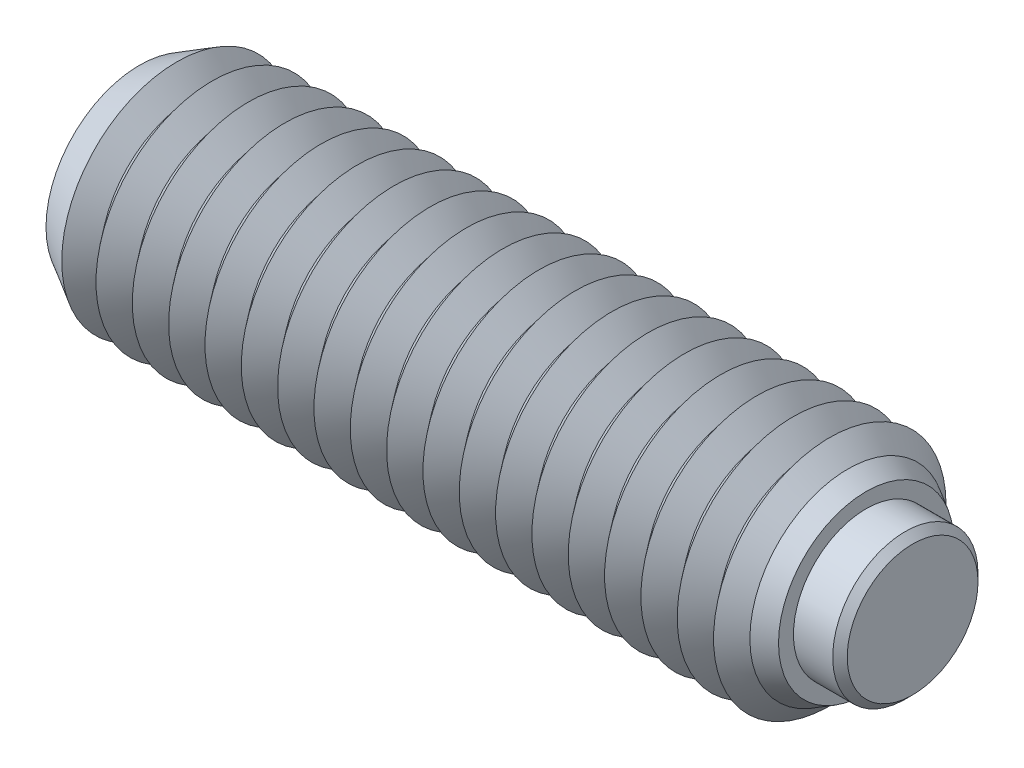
ISO-10303-21;
HEADER;
FILE_DESCRIPTION(('STEP AP214'),'2;1');
FILE_NAME('part.step','',(''),(''),'','','');
FILE_SCHEMA(('AUTOMOTIVE_DESIGN { 1 0 10303 214 1 1 1 1 }'));
ENDSEC;
DATA;
#1=APPLICATION_CONTEXT('core data for automotive mechanical design processes');
#2=APPLICATION_PROTOCOL_DEFINITION('international standard','automotive_design',2000,#1);
#3=PRODUCT_CONTEXT('',#1,'mechanical');
#4=PRODUCT('Part','Part','',(#3));
#5=PRODUCT_RELATED_PRODUCT_CATEGORY('part','',(#4));
#6=PRODUCT_DEFINITION_FORMATION('','',#4);
#7=PRODUCT_DEFINITION_CONTEXT('part definition',#1,'design');
#8=PRODUCT_DEFINITION('design','',#6,#7);
#9=PRODUCT_DEFINITION_SHAPE('','',#8);
#10=(LENGTH_UNIT() NAMED_UNIT(*) SI_UNIT(.MILLI.,.METRE.));
#11=(NAMED_UNIT(*) PLANE_ANGLE_UNIT() SI_UNIT($,.RADIAN.));
#12=(NAMED_UNIT(*) SI_UNIT($,.STERADIAN.) SOLID_ANGLE_UNIT());
#13=UNCERTAINTY_MEASURE_WITH_UNIT(LENGTH_MEASURE(1.E-05),#10,'distance_accuracy_value','');
#14=(GEOMETRIC_REPRESENTATION_CONTEXT(3) GLOBAL_UNCERTAINTY_ASSIGNED_CONTEXT((#13)) GLOBAL_UNIT_ASSIGNED_CONTEXT((#10,
#11,#12)) REPRESENTATION_CONTEXT('',''));
#15=CARTESIAN_POINT('',(0.,0.,0.));
#16=DIRECTION('',(0.,0.,1.));
#17=DIRECTION('',(1.,0.,0.));
#18=AXIS2_PLACEMENT_3D('',#15,#16,#17);
#19=CARTESIAN_POINT('',(2.225,0.,0.));
#20=DIRECTION('',(-1.,0.,0.));
#21=DIRECTION('',(0.,0.,1.));
#22=AXIS2_PLACEMENT_3D('',#19,#20,#21);
#23=CYLINDRICAL_SURFACE('',#22,2.5);
#24=CARTESIAN_POINT('',(1.975,0.,0.));
#25=DIRECTION('',(1.,0.,0.));
#26=DIRECTION('',(0.,0.,-1.));
#27=AXIS2_PLACEMENT_3D('',#24,#25,#26);
#28=CIRCLE('',#27,2.5);
#29=CARTESIAN_POINT('',(1.975,0.,-2.5));
#30=VERTEX_POINT('',#29);
#31=EDGE_CURVE('P0_E10',#30,#30,#28,.F.);
#32=ORIENTED_EDGE('',*,*,#31,.T.);
#33=EDGE_LOOP('',(#32));
#34=FACE_BOUND('',#33,.T.);
#35=CARTESIAN_POINT('',(-0.975,0.,0.));
#36=DIRECTION('',(1.,0.,0.));
#37=DIRECTION('',(0.,0.,-1.));
#38=AXIS2_PLACEMENT_3D('',#35,#36,#37);
#39=CIRCLE('',#38,2.5);
#40=CARTESIAN_POINT('',(-0.975,0.,-2.5));
#41=VERTEX_POINT('',#40);
#42=EDGE_CURVE('P0_E25',#41,#41,#39,.T.);
#43=ORIENTED_EDGE('',*,*,#42,.T.);
#44=EDGE_LOOP('',(#43));
#45=FACE_BOUND('',#44,.T.);
#46=ADVANCED_FACE('P0_F14',(#34,#45),#23,.T.);
#47=CARTESIAN_POINT('',(2.225,0.,0.));
#48=DIRECTION('',(1.,0.,0.));
#49=DIRECTION('',(0.,0.,-1.));
#50=AXIS2_PLACEMENT_3D('',#47,#48,#49);
#51=PLANE('',#50);
#52=CARTESIAN_POINT('',(2.225,0.,0.));
#53=DIRECTION('',(1.,0.,0.));
#54=DIRECTION('',(0.,0.,-1.));
#55=AXIS2_PLACEMENT_3D('',#52,#53,#54);
#56=CIRCLE('',#55,2.25);
#57=CARTESIAN_POINT('',(2.225,0.,-2.25));
#58=VERTEX_POINT('',#57);
#59=EDGE_CURVE('P0_E21',#58,#58,#56,.T.);
#60=ORIENTED_EDGE('',*,*,#59,.T.);
#61=EDGE_LOOP('',(#60));
#62=FACE_BOUND('',#61,.T.);
#63=ADVANCED_FACE('P0_F35',(#62),#51,.T.);
#64=CARTESIAN_POINT('',(-0.975,0.,0.));
#65=DIRECTION('',(1.,0.,0.));
#66=DIRECTION('',(0.,0.,-1.));
#67=AXIS2_PLACEMENT_3D('',#64,#65,#66);
#68=PLANE('',#67);
#69=ORIENTED_EDGE('',*,*,#42,.F.);
#70=EDGE_LOOP('',(#69));
#71=FACE_BOUND('',#70,.T.);
#72=ADVANCED_FACE('P0_F33',(#71),#68,.F.);
#73=CARTESIAN_POINT('',(2.225,0.,0.));
#74=DIRECTION('',(-1.,0.,0.));
#75=DIRECTION('',(0.,0.,1.));
#76=AXIS2_PLACEMENT_3D('',#73,#74,#75);
#77=CONICAL_SURFACE('',#76,2.25,0.785398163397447);
#78=ORIENTED_EDGE('',*,*,#31,.F.);
#79=EDGE_LOOP('',(#78));
#80=FACE_BOUND('',#79,.T.);
#81=ORIENTED_EDGE('',*,*,#59,.F.);
#82=EDGE_LOOP('',(#81));
#83=FACE_BOUND('',#82,.T.);
#84=ADVANCED_FACE('P0_F16',(#80,#83),#77,.T.);
#85=CLOSED_SHELL('',(#46,#63,#72,#84));
#86=MANIFOLD_SOLID_BREP('P0_B1',#85);
#87=CARTESIAN_POINT('',(-23.125,0.,0.));
#88=DIRECTION('',(-1.,0.,0.));
#89=DIRECTION('',(0.,0.,1.));
#90=AXIS2_PLACEMENT_3D('',#87,#88,#89);
#91=CONICAL_SURFACE('',#90,4.,0.895664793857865);
#92=CARTESIAN_POINT('',(-22.5,0.,0.));
#93=DIRECTION('',(1.,0.,0.));
#94=DIRECTION('',(0.,0.,-1.));
#95=AXIS2_PLACEMENT_3D('',#92,#93,#94);
#96=CIRCLE('',#95,3.2193752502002);
#97=CARTESIAN_POINT('',(-22.5,0.,-3.2193752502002));
#98=VERTEX_POINT('',#97);
#99=EDGE_CURVE('P1_E957',#98,#98,#96,.T.);
#100=ORIENTED_EDGE('',*,*,#99,.F.);
#101=EDGE_LOOP('',(#100));
#102=FACE_BOUND('',#101,.T.);
#103=CARTESIAN_POINT('',(-23.092729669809,0.,0.));
#104=DIRECTION('',(1.,0.,0.));
#105=DIRECTION('',(0.,0.,-1.));
#106=AXIS2_PLACEMENT_3D('',#103,#104,#105);
#107=CIRCLE('',#106,3.95969437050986);
#108=CARTESIAN_POINT('',(-23.092729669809,0.,-3.95969437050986));
#109=VERTEX_POINT('',#108);
#110=EDGE_CURVE('P1_E960',#109,#109,#107,.F.);
#111=ORIENTED_EDGE('',*,*,#110,.F.);
#112=EDGE_LOOP('',(#111));
#113=FACE_BOUND('',#112,.T.);
#114=ADVANCED_FACE('P1_F15',(#102,#113),#91,.T.);
#115=CARTESIAN_POINT('',(-1.25000000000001,0.,0.));
#116=DIRECTION('',(1.,0.,0.));
#117=DIRECTION('',(0.,0.,-1.));
#118=AXIS2_PLACEMENT_3D('',#115,#116,#117);
#119=CONICAL_SURFACE('',#118,3.2193752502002,0.895664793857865);
#120=CARTESIAN_POINT('',(-0.625000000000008,0.,0.));
#121=DIRECTION('',(1.,0.,0.));
#122=DIRECTION('',(0.,0.,-1.));
#123=AXIS2_PLACEMENT_3D('',#120,#121,#122);
#124=CIRCLE('',#123,4.);
#125=CARTESIAN_POINT('',(-0.625000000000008,0.,-4.));
#126=VERTEX_POINT('',#125);
#127=EDGE_CURVE('P1_E851',#126,#126,#124,.T.);
#128=ORIENTED_EDGE('',*,*,#127,.F.);
#129=EDGE_LOOP('',(#128));
#130=FACE_BOUND('',#129,.T.);
#131=CARTESIAN_POINT('',(-1.25000000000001,0.,0.));
#132=DIRECTION('',(1.,0.,0.));
#133=DIRECTION('',(0.,0.,-1.));
#134=AXIS2_PLACEMENT_3D('',#131,#132,#133);
#135=CIRCLE('',#134,3.2193752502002);
#136=CARTESIAN_POINT('',(-1.25000000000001,0.,-3.2193752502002));
#137=VERTEX_POINT('',#136);
#138=EDGE_CURVE('P1_E852',#137,#137,#135,.T.);
#139=ORIENTED_EDGE('',*,*,#138,.T.);
#140=EDGE_LOOP('',(#139));
#141=FACE_BOUND('',#140,.T.);
#142=ADVANCED_FACE('P1_F222',(#130,#141),#119,.T.);
#143=CARTESIAN_POINT('',(-1.87500000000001,0.,0.));
#144=DIRECTION('',(-1.,0.,0.));
#145=DIRECTION('',(0.,0.,1.));
#146=AXIS2_PLACEMENT_3D('',#143,#144,#145);
#147=CONICAL_SURFACE('',#146,4.,0.895664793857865);
#148=ORIENTED_EDGE('',*,*,#138,.F.);
#149=EDGE_LOOP('',(#148));
#150=FACE_BOUND('',#149,.T.);
#151=CARTESIAN_POINT('',(-1.87500000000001,0.,0.));
#152=DIRECTION('',(1.,0.,0.));
#153=DIRECTION('',(0.,0.,-1.));
#154=AXIS2_PLACEMENT_3D('',#151,#152,#153);
#155=CIRCLE('',#154,4.);
#156=CARTESIAN_POINT('',(-1.87500000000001,0.,-4.));
#157=VERTEX_POINT('',#156);
#158=EDGE_CURVE('P1_E856',#157,#157,#155,.T.);
#159=ORIENTED_EDGE('',*,*,#158,.T.);
#160=EDGE_LOOP('',(#159));
#161=FACE_BOUND('',#160,.T.);
#162=ADVANCED_FACE('P1_F227',(#150,#161),#147,.T.);
#163=CARTESIAN_POINT('',(-0.975,0.,0.));
#164=DIRECTION('',(1.,0.,0.));
#165=DIRECTION('',(0.,1.,0.));
#166=AXIS2_PLACEMENT_3D('',#163,#164,#165);
#167=PLANE('',#166);
#168=CARTESIAN_POINT('',(-0.975,0.,0.));
#169=DIRECTION('',(1.,0.,0.));
#170=DIRECTION('',(0.,1.,0.));
#171=AXIS2_PLACEMENT_3D('',#168,#169,#170);
#172=CIRCLE('',#171,2.5);
#173=CARTESIAN_POINT('',(-0.975,2.5,0.));
#174=VERTEX_POINT('',#173);
#175=EDGE_CURVE('P1_E438',#174,#174,#172,.T.);
#176=ORIENTED_EDGE('',*,*,#175,.T.);
#177=EDGE_LOOP('',(#176));
#178=FACE_BOUND('',#177,.T.);
#179=ADVANCED_FACE('P1_F365',(#178),#167,.T.);
#180=CARTESIAN_POINT('',(-0.975,0.,0.));
#181=DIRECTION('',(1.,0.,0.));
#182=DIRECTION('',(0.,1.,0.));
#183=AXIS2_PLACEMENT_3D('',#180,#181,#182);
#184=CYLINDRICAL_SURFACE('',#183,2.5);
#185=ORIENTED_EDGE('',*,*,#175,.F.);
#186=EDGE_LOOP('',(#185));
#187=FACE_BOUND('',#186,.T.);
#188=CARTESIAN_POINT('',(0.625,0.,0.));
#189=DIRECTION('',(1.,0.,0.));
#190=DIRECTION('',(0.,1.,0.));
#191=AXIS2_PLACEMENT_3D('',#188,#189,#190);
#192=CIRCLE('',#191,2.5);
#193=CARTESIAN_POINT('',(0.625,2.5,0.));
#194=VERTEX_POINT('',#193);
#195=EDGE_CURVE('P1_E441',#194,#194,#192,.T.);
#196=ORIENTED_EDGE('',*,*,#195,.T.);
#197=EDGE_LOOP('',(#196));
#198=FACE_BOUND('',#197,.T.);
#199=ADVANCED_FACE('P1_F209',(#187,#198),#184,.F.);
#200=CARTESIAN_POINT('',(0.625,3.01415608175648,0.));
#201=DIRECTION('',(1.,0.,0.));
#202=DIRECTION('',(0.,1.,0.));
#203=AXIS2_PLACEMENT_3D('',#200,#201,#202);
#204=PLANE('',#203);
#205=ORIENTED_EDGE('',*,*,#195,.F.);
#206=EDGE_LOOP('',(#205));
#207=FACE_BOUND('',#206,.T.);
#208=CARTESIAN_POINT('',(0.625,0.,0.));
#209=DIRECTION('',(1.,0.,0.));
#210=DIRECTION('',(0.,1.,0.));
#211=AXIS2_PLACEMENT_3D('',#208,#209,#210);
#212=CIRCLE('',#211,3.01415608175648);
#213=CARTESIAN_POINT('',(0.625,3.01415608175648,0.));
#214=VERTEX_POINT('',#213);
#215=EDGE_CURVE('P1_E121',#214,#214,#212,.T.);
#216=ORIENTED_EDGE('',*,*,#215,.T.);
#217=EDGE_LOOP('',(#216));
#218=FACE_BOUND('',#217,.T.);
#219=ADVANCED_FACE('P1_F206',(#207,#218),#204,.T.);
#220=CARTESIAN_POINT('',(0.625,0.,0.));
#221=DIRECTION('',(-1.,0.,0.));
#222=DIRECTION('',(0.,-1.,0.));
#223=AXIS2_PLACEMENT_3D('',#220,#221,#222);
#224=CONICAL_SURFACE('',#223,3.01415608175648,0.523598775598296);
#225=CARTESIAN_POINT('',(0.,0.,0.));
#226=DIRECTION('',(1.,0.,0.));
#227=DIRECTION('',(0.,0.,-1.));
#228=AXIS2_PLACEMENT_3D('',#225,#226,#227);
#229=CIRCLE('',#228,3.375);
#230=CARTESIAN_POINT('',(0.,0.,-3.375));
#231=VERTEX_POINT('',#230);
#232=EDGE_CURVE('P1_E429',#231,#231,#229,.T.);
#233=ORIENTED_EDGE('',*,*,#232,.T.);
#234=EDGE_LOOP('',(#233));
#235=FACE_BOUND('',#234,.T.);
#236=ORIENTED_EDGE('',*,*,#215,.F.);
#237=EDGE_LOOP('',(#236));
#238=FACE_BOUND('',#237,.T.);
#239=ADVANCED_FACE('P1_F203',(#235,#238),#224,.T.);
#240=CARTESIAN_POINT('',(0.,0.,0.));
#241=DIRECTION('',(-1.,0.,0.));
#242=DIRECTION('',(0.,0.,1.));
#243=AXIS2_PLACEMENT_3D('',#240,#241,#242);
#244=CONICAL_SURFACE('',#243,3.375,0.785398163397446);
#245=ORIENTED_EDGE('',*,*,#127,.T.);
#246=EDGE_LOOP('',(#245));
#247=FACE_BOUND('',#246,.T.);
#248=ORIENTED_EDGE('',*,*,#232,.F.);
#249=EDGE_LOOP('',(#248));
#250=FACE_BOUND('',#249,.T.);
#251=ADVANCED_FACE('P1_F17',(#247,#250),#244,.T.);
#252=CARTESIAN_POINT('',(-2.50000000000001,0.,0.));
#253=DIRECTION('',(1.,0.,0.));
#254=DIRECTION('',(0.,0.,-1.));
#255=AXIS2_PLACEMENT_3D('',#252,#253,#254);
#256=CONICAL_SURFACE('',#255,3.2193752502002,0.895664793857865);
#257=ORIENTED_EDGE('',*,*,#158,.F.);
#258=EDGE_LOOP('',(#257));
#259=FACE_BOUND('',#258,.T.);
#260=CARTESIAN_POINT('',(-2.50000000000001,0.,0.));
#261=DIRECTION('',(1.,0.,0.));
#262=DIRECTION('',(0.,0.,-1.));
#263=AXIS2_PLACEMENT_3D('',#260,#261,#262);
#264=CIRCLE('',#263,3.2193752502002);
#265=CARTESIAN_POINT('',(-2.50000000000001,0.,-3.2193752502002));
#266=VERTEX_POINT('',#265);
#267=EDGE_CURVE('P1_E861',#266,#266,#264,.T.);
#268=ORIENTED_EDGE('',*,*,#267,.T.);
#269=EDGE_LOOP('',(#268));
#270=FACE_BOUND('',#269,.T.);
#271=ADVANCED_FACE('P1_F359',(#259,#270),#256,.T.);
#272=CARTESIAN_POINT('',(-3.12500000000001,0.,0.));
#273=DIRECTION('',(-1.,0.,0.));
#274=DIRECTION('',(0.,0.,1.));
#275=AXIS2_PLACEMENT_3D('',#272,#273,#274);
#276=CONICAL_SURFACE('',#275,4.,0.895664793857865);
#277=ORIENTED_EDGE('',*,*,#267,.F.);
#278=EDGE_LOOP('',(#277));
#279=FACE_BOUND('',#278,.T.);
#280=CARTESIAN_POINT('',(-3.12500000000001,0.,0.));
#281=DIRECTION('',(1.,0.,0.));
#282=DIRECTION('',(0.,0.,-1.));
#283=AXIS2_PLACEMENT_3D('',#280,#281,#282);
#284=CIRCLE('',#283,4.);
#285=CARTESIAN_POINT('',(-3.12500000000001,0.,-4.));
#286=VERTEX_POINT('',#285);
#287=EDGE_CURVE('P1_E864',#286,#286,#284,.T.);
#288=ORIENTED_EDGE('',*,*,#287,.T.);
#289=EDGE_LOOP('',(#288));
#290=FACE_BOUND('',#289,.T.);
#291=ADVANCED_FACE('P1_F355',(#279,#290),#276,.T.);
#292=CARTESIAN_POINT('',(-3.75000000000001,0.,0.));
#293=DIRECTION('',(1.,0.,0.));
#294=DIRECTION('',(0.,0.,-1.));
#295=AXIS2_PLACEMENT_3D('',#292,#293,#294);
#296=CONICAL_SURFACE('',#295,3.2193752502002,0.895664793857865);
#297=ORIENTED_EDGE('',*,*,#287,.F.);
#298=EDGE_LOOP('',(#297));
#299=FACE_BOUND('',#298,.T.);
#300=CARTESIAN_POINT('',(-3.75000000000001,0.,0.));
#301=DIRECTION('',(1.,0.,0.));
#302=DIRECTION('',(0.,0.,-1.));
#303=AXIS2_PLACEMENT_3D('',#300,#301,#302);
#304=CIRCLE('',#303,3.2193752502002);
#305=CARTESIAN_POINT('',(-3.75000000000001,0.,-3.2193752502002));
#306=VERTEX_POINT('',#305);
#307=EDGE_CURVE('P1_E867',#306,#306,#304,.T.);
#308=ORIENTED_EDGE('',*,*,#307,.T.);
#309=EDGE_LOOP('',(#308));
#310=FACE_BOUND('',#309,.T.);
#311=ADVANCED_FACE('P1_F351',(#299,#310),#296,.T.);
#312=CARTESIAN_POINT('',(-4.37500000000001,0.,0.));
#313=DIRECTION('',(-1.,0.,0.));
#314=DIRECTION('',(0.,0.,1.));
#315=AXIS2_PLACEMENT_3D('',#312,#313,#314);
#316=CONICAL_SURFACE('',#315,4.,0.895664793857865);
#317=ORIENTED_EDGE('',*,*,#307,.F.);
#318=EDGE_LOOP('',(#317));
#319=FACE_BOUND('',#318,.T.);
#320=CARTESIAN_POINT('',(-4.37500000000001,0.,0.));
#321=DIRECTION('',(1.,0.,0.));
#322=DIRECTION('',(0.,0.,-1.));
#323=AXIS2_PLACEMENT_3D('',#320,#321,#322);
#324=CIRCLE('',#323,4.);
#325=CARTESIAN_POINT('',(-4.37500000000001,0.,-4.));
#326=VERTEX_POINT('',#325);
#327=EDGE_CURVE('P1_E870',#326,#326,#324,.T.);
#328=ORIENTED_EDGE('',*,*,#327,.T.);
#329=EDGE_LOOP('',(#328));
#330=FACE_BOUND('',#329,.T.);
#331=ADVANCED_FACE('P1_F347',(#319,#330),#316,.T.);
#332=CARTESIAN_POINT('',(-5.00000000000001,0.,0.));
#333=DIRECTION('',(1.,0.,0.));
#334=DIRECTION('',(0.,0.,-1.));
#335=AXIS2_PLACEMENT_3D('',#332,#333,#334);
#336=CONICAL_SURFACE('',#335,3.2193752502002,0.895664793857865);
#337=ORIENTED_EDGE('',*,*,#327,.F.);
#338=EDGE_LOOP('',(#337));
#339=FACE_BOUND('',#338,.T.);
#340=CARTESIAN_POINT('',(-5.00000000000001,0.,0.));
#341=DIRECTION('',(1.,0.,0.));
#342=DIRECTION('',(0.,0.,-1.));
#343=AXIS2_PLACEMENT_3D('',#340,#341,#342);
#344=CIRCLE('',#343,3.2193752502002);
#345=CARTESIAN_POINT('',(-5.00000000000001,0.,-3.2193752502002));
#346=VERTEX_POINT('',#345);
#347=EDGE_CURVE('P1_E873',#346,#346,#344,.T.);
#348=ORIENTED_EDGE('',*,*,#347,.T.);
#349=EDGE_LOOP('',(#348));
#350=FACE_BOUND('',#349,.T.);
#351=ADVANCED_FACE('P1_F343',(#339,#350),#336,.T.);
#352=CARTESIAN_POINT('',(-5.62500000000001,0.,0.));
#353=DIRECTION('',(-1.,0.,0.));
#354=DIRECTION('',(0.,0.,1.));
#355=AXIS2_PLACEMENT_3D('',#352,#353,#354);
#356=CONICAL_SURFACE('',#355,4.,0.895664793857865);
#357=ORIENTED_EDGE('',*,*,#347,.F.);
#358=EDGE_LOOP('',(#357));
#359=FACE_BOUND('',#358,.T.);
#360=CARTESIAN_POINT('',(-5.62500000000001,0.,0.));
#361=DIRECTION('',(1.,0.,0.));
#362=DIRECTION('',(0.,0.,-1.));
#363=AXIS2_PLACEMENT_3D('',#360,#361,#362);
#364=CIRCLE('',#363,4.);
#365=CARTESIAN_POINT('',(-5.62500000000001,0.,-4.));
#366=VERTEX_POINT('',#365);
#367=EDGE_CURVE('P1_E876',#366,#366,#364,.T.);
#368=ORIENTED_EDGE('',*,*,#367,.T.);
#369=EDGE_LOOP('',(#368));
#370=FACE_BOUND('',#369,.T.);
#371=ADVANCED_FACE('P1_F339',(#359,#370),#356,.T.);
#372=CARTESIAN_POINT('',(-6.25000000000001,0.,0.));
#373=DIRECTION('',(1.,0.,0.));
#374=DIRECTION('',(0.,0.,-1.));
#375=AXIS2_PLACEMENT_3D('',#372,#373,#374);
#376=CONICAL_SURFACE('',#375,3.2193752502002,0.895664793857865);
#377=ORIENTED_EDGE('',*,*,#367,.F.);
#378=EDGE_LOOP('',(#377));
#379=FACE_BOUND('',#378,.T.);
#380=CARTESIAN_POINT('',(-6.25000000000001,0.,0.));
#381=DIRECTION('',(1.,0.,0.));
#382=DIRECTION('',(0.,0.,-1.));
#383=AXIS2_PLACEMENT_3D('',#380,#381,#382);
#384=CIRCLE('',#383,3.2193752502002);
#385=CARTESIAN_POINT('',(-6.25000000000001,0.,-3.2193752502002));
#386=VERTEX_POINT('',#385);
#387=EDGE_CURVE('P1_E879',#386,#386,#384,.T.);
#388=ORIENTED_EDGE('',*,*,#387,.T.);
#389=EDGE_LOOP('',(#388));
#390=FACE_BOUND('',#389,.T.);
#391=ADVANCED_FACE('P1_F335',(#379,#390),#376,.T.);
#392=CARTESIAN_POINT('',(-6.87500000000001,0.,0.));
#393=DIRECTION('',(-1.,0.,0.));
#394=DIRECTION('',(0.,0.,1.));
#395=AXIS2_PLACEMENT_3D('',#392,#393,#394);
#396=CONICAL_SURFACE('',#395,4.,0.895664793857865);
#397=ORIENTED_EDGE('',*,*,#387,.F.);
#398=EDGE_LOOP('',(#397));
#399=FACE_BOUND('',#398,.T.);
#400=CARTESIAN_POINT('',(-6.87500000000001,0.,0.));
#401=DIRECTION('',(1.,0.,0.));
#402=DIRECTION('',(0.,0.,-1.));
#403=AXIS2_PLACEMENT_3D('',#400,#401,#402);
#404=CIRCLE('',#403,4.);
#405=CARTESIAN_POINT('',(-6.87500000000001,0.,-4.));
#406=VERTEX_POINT('',#405);
#407=EDGE_CURVE('P1_E882',#406,#406,#404,.T.);
#408=ORIENTED_EDGE('',*,*,#407,.T.);
#409=EDGE_LOOP('',(#408));
#410=FACE_BOUND('',#409,.T.);
#411=ADVANCED_FACE('P1_F331',(#399,#410),#396,.T.);
#412=CARTESIAN_POINT('',(-7.50000000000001,0.,0.));
#413=DIRECTION('',(1.,0.,0.));
#414=DIRECTION('',(0.,0.,-1.));
#415=AXIS2_PLACEMENT_3D('',#412,#413,#414);
#416=CONICAL_SURFACE('',#415,3.2193752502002,0.895664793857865);
#417=ORIENTED_EDGE('',*,*,#407,.F.);
#418=EDGE_LOOP('',(#417));
#419=FACE_BOUND('',#418,.T.);
#420=CARTESIAN_POINT('',(-7.50000000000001,0.,0.));
#421=DIRECTION('',(1.,0.,0.));
#422=DIRECTION('',(0.,0.,-1.));
#423=AXIS2_PLACEMENT_3D('',#420,#421,#422);
#424=CIRCLE('',#423,3.2193752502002);
#425=CARTESIAN_POINT('',(-7.50000000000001,0.,-3.2193752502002));
#426=VERTEX_POINT('',#425);
#427=EDGE_CURVE('P1_E885',#426,#426,#424,.T.);
#428=ORIENTED_EDGE('',*,*,#427,.T.);
#429=EDGE_LOOP('',(#428));
#430=FACE_BOUND('',#429,.T.);
#431=ADVANCED_FACE('P1_F327',(#419,#430),#416,.T.);
#432=CARTESIAN_POINT('',(-8.12500000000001,0.,0.));
#433=DIRECTION('',(-1.,0.,0.));
#434=DIRECTION('',(0.,0.,1.));
#435=AXIS2_PLACEMENT_3D('',#432,#433,#434);
#436=CONICAL_SURFACE('',#435,4.,0.895664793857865);
#437=ORIENTED_EDGE('',*,*,#427,.F.);
#438=EDGE_LOOP('',(#437));
#439=FACE_BOUND('',#438,.T.);
#440=CARTESIAN_POINT('',(-8.12500000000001,0.,0.));
#441=DIRECTION('',(1.,0.,0.));
#442=DIRECTION('',(0.,0.,-1.));
#443=AXIS2_PLACEMENT_3D('',#440,#441,#442);
#444=CIRCLE('',#443,4.);
#445=CARTESIAN_POINT('',(-8.12500000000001,0.,-4.));
#446=VERTEX_POINT('',#445);
#447=EDGE_CURVE('P1_E888',#446,#446,#444,.T.);
#448=ORIENTED_EDGE('',*,*,#447,.T.);
#449=EDGE_LOOP('',(#448));
#450=FACE_BOUND('',#449,.T.);
#451=ADVANCED_FACE('P1_F323',(#439,#450),#436,.T.);
#452=CARTESIAN_POINT('',(-8.75000000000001,0.,0.));
#453=DIRECTION('',(1.,0.,0.));
#454=DIRECTION('',(0.,0.,-1.));
#455=AXIS2_PLACEMENT_3D('',#452,#453,#454);
#456=CONICAL_SURFACE('',#455,3.2193752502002,0.895664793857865);
#457=ORIENTED_EDGE('',*,*,#447,.F.);
#458=EDGE_LOOP('',(#457));
#459=FACE_BOUND('',#458,.T.);
#460=CARTESIAN_POINT('',(-8.75000000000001,0.,0.));
#461=DIRECTION('',(1.,0.,0.));
#462=DIRECTION('',(0.,0.,-1.));
#463=AXIS2_PLACEMENT_3D('',#460,#461,#462);
#464=CIRCLE('',#463,3.2193752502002);
#465=CARTESIAN_POINT('',(-8.75000000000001,0.,-3.2193752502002));
#466=VERTEX_POINT('',#465);
#467=EDGE_CURVE('P1_E891',#466,#466,#464,.T.);
#468=ORIENTED_EDGE('',*,*,#467,.T.);
#469=EDGE_LOOP('',(#468));
#470=FACE_BOUND('',#469,.T.);
#471=ADVANCED_FACE('P1_F319',(#459,#470),#456,.T.);
#472=CARTESIAN_POINT('',(-9.37500000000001,0.,0.));
#473=DIRECTION('',(-1.,0.,0.));
#474=DIRECTION('',(0.,0.,1.));
#475=AXIS2_PLACEMENT_3D('',#472,#473,#474);
#476=CONICAL_SURFACE('',#475,4.,0.895664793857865);
#477=ORIENTED_EDGE('',*,*,#467,.F.);
#478=EDGE_LOOP('',(#477));
#479=FACE_BOUND('',#478,.T.);
#480=CARTESIAN_POINT('',(-9.37500000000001,0.,0.));
#481=DIRECTION('',(1.,0.,0.));
#482=DIRECTION('',(0.,0.,-1.));
#483=AXIS2_PLACEMENT_3D('',#480,#481,#482);
#484=CIRCLE('',#483,4.);
#485=CARTESIAN_POINT('',(-9.37500000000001,0.,-4.));
#486=VERTEX_POINT('',#485);
#487=EDGE_CURVE('P1_E894',#486,#486,#484,.T.);
#488=ORIENTED_EDGE('',*,*,#487,.T.);
#489=EDGE_LOOP('',(#488));
#490=FACE_BOUND('',#489,.T.);
#491=ADVANCED_FACE('P1_F315',(#479,#490),#476,.T.);
#492=CARTESIAN_POINT('',(-10.,0.,0.));
#493=DIRECTION('',(1.,0.,0.));
#494=DIRECTION('',(0.,0.,-1.));
#495=AXIS2_PLACEMENT_3D('',#492,#493,#494);
#496=CONICAL_SURFACE('',#495,3.2193752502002,0.895664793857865);
#497=ORIENTED_EDGE('',*,*,#487,.F.);
#498=EDGE_LOOP('',(#497));
#499=FACE_BOUND('',#498,.T.);
#500=CARTESIAN_POINT('',(-10.,0.,0.));
#501=DIRECTION('',(1.,0.,0.));
#502=DIRECTION('',(0.,0.,-1.));
#503=AXIS2_PLACEMENT_3D('',#500,#501,#502);
#504=CIRCLE('',#503,3.2193752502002);
#505=CARTESIAN_POINT('',(-10.,0.,-3.2193752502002));
#506=VERTEX_POINT('',#505);
#507=EDGE_CURVE('P1_E897',#506,#506,#504,.T.);
#508=ORIENTED_EDGE('',*,*,#507,.T.);
#509=EDGE_LOOP('',(#508));
#510=FACE_BOUND('',#509,.T.);
#511=ADVANCED_FACE('P1_F311',(#499,#510),#496,.T.);
#512=CARTESIAN_POINT('',(-10.625,0.,0.));
#513=DIRECTION('',(-1.,0.,0.));
#514=DIRECTION('',(0.,0.,1.));
#515=AXIS2_PLACEMENT_3D('',#512,#513,#514);
#516=CONICAL_SURFACE('',#515,4.,0.895664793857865);
#517=ORIENTED_EDGE('',*,*,#507,.F.);
#518=EDGE_LOOP('',(#517));
#519=FACE_BOUND('',#518,.T.);
#520=CARTESIAN_POINT('',(-10.625,0.,0.));
#521=DIRECTION('',(1.,0.,0.));
#522=DIRECTION('',(0.,0.,-1.));
#523=AXIS2_PLACEMENT_3D('',#520,#521,#522);
#524=CIRCLE('',#523,4.);
#525=CARTESIAN_POINT('',(-10.625,0.,-4.));
#526=VERTEX_POINT('',#525);
#527=EDGE_CURVE('P1_E900',#526,#526,#524,.T.);
#528=ORIENTED_EDGE('',*,*,#527,.T.);
#529=EDGE_LOOP('',(#528));
#530=FACE_BOUND('',#529,.T.);
#531=ADVANCED_FACE('P1_F307',(#519,#530),#516,.T.);
#532=CARTESIAN_POINT('',(-11.25,0.,0.));
#533=DIRECTION('',(1.,0.,0.));
#534=DIRECTION('',(0.,0.,-1.));
#535=AXIS2_PLACEMENT_3D('',#532,#533,#534);
#536=CONICAL_SURFACE('',#535,3.2193752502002,0.895664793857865);
#537=ORIENTED_EDGE('',*,*,#527,.F.);
#538=EDGE_LOOP('',(#537));
#539=FACE_BOUND('',#538,.T.);
#540=CARTESIAN_POINT('',(-11.25,0.,0.));
#541=DIRECTION('',(1.,0.,0.));
#542=DIRECTION('',(0.,0.,-1.));
#543=AXIS2_PLACEMENT_3D('',#540,#541,#542);
#544=CIRCLE('',#543,3.2193752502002);
#545=CARTESIAN_POINT('',(-11.25,0.,-3.2193752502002));
#546=VERTEX_POINT('',#545);
#547=EDGE_CURVE('P1_E903',#546,#546,#544,.T.);
#548=ORIENTED_EDGE('',*,*,#547,.T.);
#549=EDGE_LOOP('',(#548));
#550=FACE_BOUND('',#549,.T.);
#551=ADVANCED_FACE('P1_F303',(#539,#550),#536,.T.);
#552=CARTESIAN_POINT('',(-11.875,0.,0.));
#553=DIRECTION('',(-1.,0.,0.));
#554=DIRECTION('',(0.,0.,1.));
#555=AXIS2_PLACEMENT_3D('',#552,#553,#554);
#556=CONICAL_SURFACE('',#555,4.,0.895664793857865);
#557=ORIENTED_EDGE('',*,*,#547,.F.);
#558=EDGE_LOOP('',(#557));
#559=FACE_BOUND('',#558,.T.);
#560=CARTESIAN_POINT('',(-11.875,0.,0.));
#561=DIRECTION('',(1.,0.,0.));
#562=DIRECTION('',(0.,0.,-1.));
#563=AXIS2_PLACEMENT_3D('',#560,#561,#562);
#564=CIRCLE('',#563,4.);
#565=CARTESIAN_POINT('',(-11.875,0.,-4.));
#566=VERTEX_POINT('',#565);
#567=EDGE_CURVE('P1_E906',#566,#566,#564,.T.);
#568=ORIENTED_EDGE('',*,*,#567,.T.);
#569=EDGE_LOOP('',(#568));
#570=FACE_BOUND('',#569,.T.);
#571=ADVANCED_FACE('P1_F299',(#559,#570),#556,.T.);
#572=CARTESIAN_POINT('',(-12.5,0.,0.));
#573=DIRECTION('',(1.,0.,0.));
#574=DIRECTION('',(0.,0.,-1.));
#575=AXIS2_PLACEMENT_3D('',#572,#573,#574);
#576=CONICAL_SURFACE('',#575,3.2193752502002,0.895664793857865);
#577=ORIENTED_EDGE('',*,*,#567,.F.);
#578=EDGE_LOOP('',(#577));
#579=FACE_BOUND('',#578,.T.);
#580=CARTESIAN_POINT('',(-12.5,0.,0.));
#581=DIRECTION('',(1.,0.,0.));
#582=DIRECTION('',(0.,0.,-1.));
#583=AXIS2_PLACEMENT_3D('',#580,#581,#582);
#584=CIRCLE('',#583,3.2193752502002);
#585=CARTESIAN_POINT('',(-12.5,0.,-3.2193752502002));
#586=VERTEX_POINT('',#585);
#587=EDGE_CURVE('P1_E909',#586,#586,#584,.T.);
#588=ORIENTED_EDGE('',*,*,#587,.T.);
#589=EDGE_LOOP('',(#588));
#590=FACE_BOUND('',#589,.T.);
#591=ADVANCED_FACE('P1_F295',(#579,#590),#576,.T.);
#592=CARTESIAN_POINT('',(-13.125,0.,0.));
#593=DIRECTION('',(-1.,0.,0.));
#594=DIRECTION('',(0.,0.,1.));
#595=AXIS2_PLACEMENT_3D('',#592,#593,#594);
#596=CONICAL_SURFACE('',#595,4.,0.895664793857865);
#597=ORIENTED_EDGE('',*,*,#587,.F.);
#598=EDGE_LOOP('',(#597));
#599=FACE_BOUND('',#598,.T.);
#600=CARTESIAN_POINT('',(-13.125,0.,0.));
#601=DIRECTION('',(1.,0.,0.));
#602=DIRECTION('',(0.,0.,-1.));
#603=AXIS2_PLACEMENT_3D('',#600,#601,#602);
#604=CIRCLE('',#603,4.);
#605=CARTESIAN_POINT('',(-13.125,0.,-4.));
#606=VERTEX_POINT('',#605);
#607=EDGE_CURVE('P1_E912',#606,#606,#604,.T.);
#608=ORIENTED_EDGE('',*,*,#607,.T.);
#609=EDGE_LOOP('',(#608));
#610=FACE_BOUND('',#609,.T.);
#611=ADVANCED_FACE('P1_F291',(#599,#610),#596,.T.);
#612=CARTESIAN_POINT('',(-13.75,0.,0.));
#613=DIRECTION('',(1.,0.,0.));
#614=DIRECTION('',(0.,0.,-1.));
#615=AXIS2_PLACEMENT_3D('',#612,#613,#614);
#616=CONICAL_SURFACE('',#615,3.2193752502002,0.895664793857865);
#617=ORIENTED_EDGE('',*,*,#607,.F.);
#618=EDGE_LOOP('',(#617));
#619=FACE_BOUND('',#618,.T.);
#620=CARTESIAN_POINT('',(-13.75,0.,0.));
#621=DIRECTION('',(1.,0.,0.));
#622=DIRECTION('',(0.,0.,-1.));
#623=AXIS2_PLACEMENT_3D('',#620,#621,#622);
#624=CIRCLE('',#623,3.2193752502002);
#625=CARTESIAN_POINT('',(-13.75,0.,-3.2193752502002));
#626=VERTEX_POINT('',#625);
#627=EDGE_CURVE('P1_E915',#626,#626,#624,.T.);
#628=ORIENTED_EDGE('',*,*,#627,.T.);
#629=EDGE_LOOP('',(#628));
#630=FACE_BOUND('',#629,.T.);
#631=ADVANCED_FACE('P1_F287',(#619,#630),#616,.T.);
#632=CARTESIAN_POINT('',(-14.375,0.,0.));
#633=DIRECTION('',(-1.,0.,0.));
#634=DIRECTION('',(0.,0.,1.));
#635=AXIS2_PLACEMENT_3D('',#632,#633,#634);
#636=CONICAL_SURFACE('',#635,4.,0.895664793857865);
#637=ORIENTED_EDGE('',*,*,#627,.F.);
#638=EDGE_LOOP('',(#637));
#639=FACE_BOUND('',#638,.T.);
#640=CARTESIAN_POINT('',(-14.375,0.,0.));
#641=DIRECTION('',(1.,0.,0.));
#642=DIRECTION('',(0.,0.,-1.));
#643=AXIS2_PLACEMENT_3D('',#640,#641,#642);
#644=CIRCLE('',#643,4.);
#645=CARTESIAN_POINT('',(-14.375,0.,-4.));
#646=VERTEX_POINT('',#645);
#647=EDGE_CURVE('P1_E918',#646,#646,#644,.T.);
#648=ORIENTED_EDGE('',*,*,#647,.T.);
#649=EDGE_LOOP('',(#648));
#650=FACE_BOUND('',#649,.T.);
#651=ADVANCED_FACE('P1_F283',(#639,#650),#636,.T.);
#652=CARTESIAN_POINT('',(-15.,0.,0.));
#653=DIRECTION('',(1.,0.,0.));
#654=DIRECTION('',(0.,0.,-1.));
#655=AXIS2_PLACEMENT_3D('',#652,#653,#654);
#656=CONICAL_SURFACE('',#655,3.2193752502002,0.895664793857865);
#657=ORIENTED_EDGE('',*,*,#647,.F.);
#658=EDGE_LOOP('',(#657));
#659=FACE_BOUND('',#658,.T.);
#660=CARTESIAN_POINT('',(-15.,0.,0.));
#661=DIRECTION('',(1.,0.,0.));
#662=DIRECTION('',(0.,0.,-1.));
#663=AXIS2_PLACEMENT_3D('',#660,#661,#662);
#664=CIRCLE('',#663,3.2193752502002);
#665=CARTESIAN_POINT('',(-15.,0.,-3.2193752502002));
#666=VERTEX_POINT('',#665);
#667=EDGE_CURVE('P1_E921',#666,#666,#664,.T.);
#668=ORIENTED_EDGE('',*,*,#667,.T.);
#669=EDGE_LOOP('',(#668));
#670=FACE_BOUND('',#669,.T.);
#671=ADVANCED_FACE('P1_F279',(#659,#670),#656,.T.);
#672=CARTESIAN_POINT('',(-15.625,0.,0.));
#673=DIRECTION('',(-1.,0.,0.));
#674=DIRECTION('',(0.,0.,1.));
#675=AXIS2_PLACEMENT_3D('',#672,#673,#674);
#676=CONICAL_SURFACE('',#675,4.,0.895664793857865);
#677=ORIENTED_EDGE('',*,*,#667,.F.);
#678=EDGE_LOOP('',(#677));
#679=FACE_BOUND('',#678,.T.);
#680=CARTESIAN_POINT('',(-15.625,0.,0.));
#681=DIRECTION('',(1.,0.,0.));
#682=DIRECTION('',(0.,0.,-1.));
#683=AXIS2_PLACEMENT_3D('',#680,#681,#682);
#684=CIRCLE('',#683,4.);
#685=CARTESIAN_POINT('',(-15.625,0.,-4.));
#686=VERTEX_POINT('',#685);
#687=EDGE_CURVE('P1_E924',#686,#686,#684,.T.);
#688=ORIENTED_EDGE('',*,*,#687,.T.);
#689=EDGE_LOOP('',(#688));
#690=FACE_BOUND('',#689,.T.);
#691=ADVANCED_FACE('P1_F275',(#679,#690),#676,.T.);
#692=CARTESIAN_POINT('',(-16.25,0.,0.));
#693=DIRECTION('',(1.,0.,0.));
#694=DIRECTION('',(0.,0.,-1.));
#695=AXIS2_PLACEMENT_3D('',#692,#693,#694);
#696=CONICAL_SURFACE('',#695,3.2193752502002,0.895664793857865);
#697=ORIENTED_EDGE('',*,*,#687,.F.);
#698=EDGE_LOOP('',(#697));
#699=FACE_BOUND('',#698,.T.);
#700=CARTESIAN_POINT('',(-16.25,0.,0.));
#701=DIRECTION('',(1.,0.,0.));
#702=DIRECTION('',(0.,0.,-1.));
#703=AXIS2_PLACEMENT_3D('',#700,#701,#702);
#704=CIRCLE('',#703,3.2193752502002);
#705=CARTESIAN_POINT('',(-16.25,0.,-3.2193752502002));
#706=VERTEX_POINT('',#705);
#707=EDGE_CURVE('P1_E927',#706,#706,#704,.T.);
#708=ORIENTED_EDGE('',*,*,#707,.T.);
#709=EDGE_LOOP('',(#708));
#710=FACE_BOUND('',#709,.T.);
#711=ADVANCED_FACE('P1_F271',(#699,#710),#696,.T.);
#712=CARTESIAN_POINT('',(-16.875,0.,0.));
#713=DIRECTION('',(-1.,0.,0.));
#714=DIRECTION('',(0.,0.,1.));
#715=AXIS2_PLACEMENT_3D('',#712,#713,#714);
#716=CONICAL_SURFACE('',#715,4.,0.895664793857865);
#717=ORIENTED_EDGE('',*,*,#707,.F.);
#718=EDGE_LOOP('',(#717));
#719=FACE_BOUND('',#718,.T.);
#720=CARTESIAN_POINT('',(-16.875,0.,0.));
#721=DIRECTION('',(1.,0.,0.));
#722=DIRECTION('',(0.,0.,-1.));
#723=AXIS2_PLACEMENT_3D('',#720,#721,#722);
#724=CIRCLE('',#723,4.);
#725=CARTESIAN_POINT('',(-16.875,0.,-4.));
#726=VERTEX_POINT('',#725);
#727=EDGE_CURVE('P1_E930',#726,#726,#724,.T.);
#728=ORIENTED_EDGE('',*,*,#727,.T.);
#729=EDGE_LOOP('',(#728));
#730=FACE_BOUND('',#729,.T.);
#731=ADVANCED_FACE('P1_F267',(#719,#730),#716,.T.);
#732=CARTESIAN_POINT('',(-17.5,0.,0.));
#733=DIRECTION('',(1.,0.,0.));
#734=DIRECTION('',(0.,0.,-1.));
#735=AXIS2_PLACEMENT_3D('',#732,#733,#734);
#736=CONICAL_SURFACE('',#735,3.2193752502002,0.895664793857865);
#737=ORIENTED_EDGE('',*,*,#727,.F.);
#738=EDGE_LOOP('',(#737));
#739=FACE_BOUND('',#738,.T.);
#740=CARTESIAN_POINT('',(-17.5,0.,0.));
#741=DIRECTION('',(1.,0.,0.));
#742=DIRECTION('',(0.,0.,-1.));
#743=AXIS2_PLACEMENT_3D('',#740,#741,#742);
#744=CIRCLE('',#743,3.2193752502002);
#745=CARTESIAN_POINT('',(-17.5,0.,-3.2193752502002));
#746=VERTEX_POINT('',#745);
#747=EDGE_CURVE('P1_E933',#746,#746,#744,.T.);
#748=ORIENTED_EDGE('',*,*,#747,.T.);
#749=EDGE_LOOP('',(#748));
#750=FACE_BOUND('',#749,.T.);
#751=ADVANCED_FACE('P1_F263',(#739,#750),#736,.T.);
#752=CARTESIAN_POINT('',(-18.125,0.,0.));
#753=DIRECTION('',(-1.,0.,0.));
#754=DIRECTION('',(0.,0.,1.));
#755=AXIS2_PLACEMENT_3D('',#752,#753,#754);
#756=CONICAL_SURFACE('',#755,4.,0.895664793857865);
#757=ORIENTED_EDGE('',*,*,#747,.F.);
#758=EDGE_LOOP('',(#757));
#759=FACE_BOUND('',#758,.T.);
#760=CARTESIAN_POINT('',(-18.125,0.,0.));
#761=DIRECTION('',(1.,0.,0.));
#762=DIRECTION('',(0.,0.,-1.));
#763=AXIS2_PLACEMENT_3D('',#760,#761,#762);
#764=CIRCLE('',#763,4.);
#765=CARTESIAN_POINT('',(-18.125,0.,-4.));
#766=VERTEX_POINT('',#765);
#767=EDGE_CURVE('P1_E936',#766,#766,#764,.T.);
#768=ORIENTED_EDGE('',*,*,#767,.T.);
#769=EDGE_LOOP('',(#768));
#770=FACE_BOUND('',#769,.T.);
#771=ADVANCED_FACE('P1_F259',(#759,#770),#756,.T.);
#772=CARTESIAN_POINT('',(-18.75,0.,0.));
#773=DIRECTION('',(1.,0.,0.));
#774=DIRECTION('',(0.,0.,-1.));
#775=AXIS2_PLACEMENT_3D('',#772,#773,#774);
#776=CONICAL_SURFACE('',#775,3.2193752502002,0.895664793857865);
#777=ORIENTED_EDGE('',*,*,#767,.F.);
#778=EDGE_LOOP('',(#777));
#779=FACE_BOUND('',#778,.T.);
#780=CARTESIAN_POINT('',(-18.75,0.,0.));
#781=DIRECTION('',(1.,0.,0.));
#782=DIRECTION('',(0.,0.,-1.));
#783=AXIS2_PLACEMENT_3D('',#780,#781,#782);
#784=CIRCLE('',#783,3.2193752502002);
#785=CARTESIAN_POINT('',(-18.75,0.,-3.2193752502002));
#786=VERTEX_POINT('',#785);
#787=EDGE_CURVE('P1_E939',#786,#786,#784,.T.);
#788=ORIENTED_EDGE('',*,*,#787,.T.);
#789=EDGE_LOOP('',(#788));
#790=FACE_BOUND('',#789,.T.);
#791=ADVANCED_FACE('P1_F255',(#779,#790),#776,.T.);
#792=CARTESIAN_POINT('',(-19.375,0.,0.));
#793=DIRECTION('',(-1.,0.,0.));
#794=DIRECTION('',(0.,0.,1.));
#795=AXIS2_PLACEMENT_3D('',#792,#793,#794);
#796=CONICAL_SURFACE('',#795,4.,0.895664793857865);
#797=ORIENTED_EDGE('',*,*,#787,.F.);
#798=EDGE_LOOP('',(#797));
#799=FACE_BOUND('',#798,.T.);
#800=CARTESIAN_POINT('',(-19.375,0.,0.));
#801=DIRECTION('',(1.,0.,0.));
#802=DIRECTION('',(0.,0.,-1.));
#803=AXIS2_PLACEMENT_3D('',#800,#801,#802);
#804=CIRCLE('',#803,4.);
#805=CARTESIAN_POINT('',(-19.375,0.,-4.));
#806=VERTEX_POINT('',#805);
#807=EDGE_CURVE('P1_E942',#806,#806,#804,.T.);
#808=ORIENTED_EDGE('',*,*,#807,.T.);
#809=EDGE_LOOP('',(#808));
#810=FACE_BOUND('',#809,.T.);
#811=ADVANCED_FACE('P1_F251',(#799,#810),#796,.T.);
#812=CARTESIAN_POINT('',(-20.,0.,0.));
#813=DIRECTION('',(1.,0.,0.));
#814=DIRECTION('',(0.,0.,-1.));
#815=AXIS2_PLACEMENT_3D('',#812,#813,#814);
#816=CONICAL_SURFACE('',#815,3.2193752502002,0.895664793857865);
#817=ORIENTED_EDGE('',*,*,#807,.F.);
#818=EDGE_LOOP('',(#817));
#819=FACE_BOUND('',#818,.T.);
#820=CARTESIAN_POINT('',(-20.,0.,0.));
#821=DIRECTION('',(1.,0.,0.));
#822=DIRECTION('',(0.,0.,-1.));
#823=AXIS2_PLACEMENT_3D('',#820,#821,#822);
#824=CIRCLE('',#823,3.2193752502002);
#825=CARTESIAN_POINT('',(-20.,0.,-3.2193752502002));
#826=VERTEX_POINT('',#825);
#827=EDGE_CURVE('P1_E945',#826,#826,#824,.T.);
#828=ORIENTED_EDGE('',*,*,#827,.T.);
#829=EDGE_LOOP('',(#828));
#830=FACE_BOUND('',#829,.T.);
#831=ADVANCED_FACE('P1_F247',(#819,#830),#816,.T.);
#832=CARTESIAN_POINT('',(-20.625,0.,0.));
#833=DIRECTION('',(-1.,0.,0.));
#834=DIRECTION('',(0.,0.,1.));
#835=AXIS2_PLACEMENT_3D('',#832,#833,#834);
#836=CONICAL_SURFACE('',#835,4.,0.895664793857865);
#837=ORIENTED_EDGE('',*,*,#827,.F.);
#838=EDGE_LOOP('',(#837));
#839=FACE_BOUND('',#838,.T.);
#840=CARTESIAN_POINT('',(-20.625,0.,0.));
#841=DIRECTION('',(1.,0.,0.));
#842=DIRECTION('',(0.,0.,-1.));
#843=AXIS2_PLACEMENT_3D('',#840,#841,#842);
#844=CIRCLE('',#843,4.);
#845=CARTESIAN_POINT('',(-20.625,0.,-4.));
#846=VERTEX_POINT('',#845);
#847=EDGE_CURVE('P1_E948',#846,#846,#844,.T.);
#848=ORIENTED_EDGE('',*,*,#847,.T.);
#849=EDGE_LOOP('',(#848));
#850=FACE_BOUND('',#849,.T.);
#851=ADVANCED_FACE('P1_F243',(#839,#850),#836,.T.);
#852=CARTESIAN_POINT('',(-21.25,0.,0.));
#853=DIRECTION('',(1.,0.,0.));
#854=DIRECTION('',(0.,0.,-1.));
#855=AXIS2_PLACEMENT_3D('',#852,#853,#854);
#856=CONICAL_SURFACE('',#855,3.2193752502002,0.895664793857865);
#857=ORIENTED_EDGE('',*,*,#847,.F.);
#858=EDGE_LOOP('',(#857));
#859=FACE_BOUND('',#858,.T.);
#860=CARTESIAN_POINT('',(-21.25,0.,0.));
#861=DIRECTION('',(1.,0.,0.));
#862=DIRECTION('',(0.,0.,-1.));
#863=AXIS2_PLACEMENT_3D('',#860,#861,#862);
#864=CIRCLE('',#863,3.2193752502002);
#865=CARTESIAN_POINT('',(-21.25,0.,-3.2193752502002));
#866=VERTEX_POINT('',#865);
#867=EDGE_CURVE('P1_E951',#866,#866,#864,.T.);
#868=ORIENTED_EDGE('',*,*,#867,.T.);
#869=EDGE_LOOP('',(#868));
#870=FACE_BOUND('',#869,.T.);
#871=ADVANCED_FACE('P1_F239',(#859,#870),#856,.T.);
#872=CARTESIAN_POINT('',(-21.875,0.,0.));
#873=DIRECTION('',(-1.,0.,0.));
#874=DIRECTION('',(0.,0.,1.));
#875=AXIS2_PLACEMENT_3D('',#872,#873,#874);
#876=CONICAL_SURFACE('',#875,4.,0.895664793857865);
#877=ORIENTED_EDGE('',*,*,#867,.F.);
#878=EDGE_LOOP('',(#877));
#879=FACE_BOUND('',#878,.T.);
#880=CARTESIAN_POINT('',(-21.875,0.,0.));
#881=DIRECTION('',(1.,0.,0.));
#882=DIRECTION('',(0.,0.,-1.));
#883=AXIS2_PLACEMENT_3D('',#880,#881,#882);
#884=CIRCLE('',#883,4.);
#885=CARTESIAN_POINT('',(-21.875,0.,-4.));
#886=VERTEX_POINT('',#885);
#887=EDGE_CURVE('P1_E954',#886,#886,#884,.T.);
#888=ORIENTED_EDGE('',*,*,#887,.T.);
#889=EDGE_LOOP('',(#888));
#890=FACE_BOUND('',#889,.T.);
#891=ADVANCED_FACE('P1_F235',(#879,#890),#876,.T.);
#892=CARTESIAN_POINT('',(-22.5,0.,0.));
#893=DIRECTION('',(1.,0.,0.));
#894=DIRECTION('',(0.,0.,-1.));
#895=AXIS2_PLACEMENT_3D('',#892,#893,#894);
#896=CONICAL_SURFACE('',#895,3.2193752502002,0.895664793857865);
#897=ORIENTED_EDGE('',*,*,#887,.F.);
#898=EDGE_LOOP('',(#897));
#899=FACE_BOUND('',#898,.T.);
#900=ORIENTED_EDGE('',*,*,#99,.T.);
#901=EDGE_LOOP('',(#900));
#902=FACE_BOUND('',#901,.T.);
#903=ADVANCED_FACE('P1_F219',(#899,#902),#896,.T.);
#904=CARTESIAN_POINT('',(-24.375,0.,0.));
#905=DIRECTION('',(1.,0.,0.));
#906=DIRECTION('',(0.,0.,1.));
#907=AXIS2_PLACEMENT_3D('',#904,#905,#906);
#908=CONICAL_SURFACE('',#907,3.2193752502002,0.5235987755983);
#909=CARTESIAN_POINT('',(-24.375,0.,0.));
#910=DIRECTION('',(-1.,0.,0.));
#911=DIRECTION('',(0.,0.,1.));
#912=AXIS2_PLACEMENT_3D('',#909,#910,#911);
#913=CIRCLE('',#912,3.2193752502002);
#914=CARTESIAN_POINT('',(-24.375,0.,3.2193752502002));
#915=VERTEX_POINT('',#914);
#916=EDGE_CURVE('P1_E962',#915,#915,#913,.T.);
#917=ORIENTED_EDGE('',*,*,#916,.F.);
#918=EDGE_LOOP('',(#917));
#919=FACE_BOUND('',#918,.T.);
#920=ORIENTED_EDGE('',*,*,#110,.T.);
#921=EDGE_LOOP('',(#920));
#922=FACE_BOUND('',#921,.T.);
#923=ADVANCED_FACE('P1_F159',(#919,#922),#908,.T.);
#924=CARTESIAN_POINT('',(-24.375,0.,0.));
#925=DIRECTION('',(1.,0.,0.));
#926=DIRECTION('',(0.,0.,-1.));
#927=AXIS2_PLACEMENT_3D('',#924,#925,#926);
#928=PLANE('',#927);
#929=CARTESIAN_POINT('',(-24.375,0.,0.));
#930=DIRECTION('',(1.,0.,0.));
#931=DIRECTION('',(0.,0.,-1.));
#932=AXIS2_PLACEMENT_3D('',#929,#930,#931);
#933=CIRCLE('',#932,2.3094010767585);
#934=CARTESIAN_POINT('',(-24.375,-2.,-1.15470053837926));
#935=VERTEX_POINT('',#934);
#936=CARTESIAN_POINT('',(-24.375,0.,-2.3094010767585));
#937=VERTEX_POINT('',#936);
#938=EDGE_CURVE('P1_E19',#935,#937,#933,.T.);
#939=ORIENTED_EDGE('',*,*,#938,.T.);
#940=CARTESIAN_POINT('',(-24.375,2.,-1.15470053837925));
#941=VERTEX_POINT('',#940);
#942=EDGE_CURVE('P1_E10',#937,#941,#933,.T.);
#943=ORIENTED_EDGE('',*,*,#942,.T.);
#944=CARTESIAN_POINT('',(-24.375,2.,1.15470053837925));
#945=VERTEX_POINT('',#944);
#946=EDGE_CURVE('P1_E24',#941,#945,#933,.T.);
#947=ORIENTED_EDGE('',*,*,#946,.T.);
#948=CARTESIAN_POINT('',(-24.375,0.,0.));
#949=DIRECTION('',(-1.,0.,0.));
#950=DIRECTION('',(0.,0.,1.));
#951=AXIS2_PLACEMENT_3D('',#948,#949,#950);
#952=CIRCLE('',#951,2.3094010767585);
#953=CARTESIAN_POINT('',(-24.375,0.,2.3094010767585));
#954=VERTEX_POINT('',#953);
#955=EDGE_CURVE('P1_E92',#954,#945,#952,.T.);
#956=ORIENTED_EDGE('',*,*,#955,.F.);
#957=CARTESIAN_POINT('',(-24.375,-2.,1.15470053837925));
#958=VERTEX_POINT('',#957);
#959=EDGE_CURVE('P1_E101',#954,#958,#933,.T.);
#960=ORIENTED_EDGE('',*,*,#959,.T.);
#961=EDGE_CURVE('P1_E107',#958,#935,#933,.T.);
#962=ORIENTED_EDGE('',*,*,#961,.T.);
#963=EDGE_LOOP('',(#939,#943,#947,#956,#960,#962));
#964=FACE_BOUND('',#963,.T.);
#965=ORIENTED_EDGE('',*,*,#916,.T.);
#966=EDGE_LOOP('',(#965));
#967=FACE_BOUND('',#966,.T.);
#968=ADVANCED_FACE('P1_F108',(#964,#967),#928,.F.);
#969=CARTESIAN_POINT('',(-24.375,0.,0.));
#970=DIRECTION('',(-1.,0.,0.));
#971=DIRECTION('',(0.,0.,1.));
#972=AXIS2_PLACEMENT_3D('',#969,#970,#971);
#973=CONICAL_SURFACE('',#972,2.3094010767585,1.0471975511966);
#974=ORIENTED_EDGE('',*,*,#938,.F.);
#975=CARTESIAN_POINT('',(-24.3750666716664,0.000199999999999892,-2.30951654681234));
#976=CARTESIAN_POINT('',(-24.3457567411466,-0.0876912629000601,-2.25877250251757));
#977=CARTESIAN_POINT('',(-24.3191000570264,-0.176341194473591,-2.20759044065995));
#978=CARTESIAN_POINT('',(-24.2725696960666,-0.355176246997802,-2.10433997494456));
#979=CARTESIAN_POINT('',(-24.2527124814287,-0.445364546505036,-2.0522697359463));
#980=CARTESIAN_POINT('',(-24.2218006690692,-0.624623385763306,-1.94877459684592));
#981=CARTESIAN_POINT('',(-24.2105403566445,-0.713666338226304,-1.89736562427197));
#982=CARTESIAN_POINT('',(-24.1970958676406,-0.892171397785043,-1.79430568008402));
#983=CARTESIAN_POINT('',(-24.1949005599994,-0.981632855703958,-1.74265508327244));
#984=CARTESIAN_POINT('',(-24.1994581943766,-1.1488083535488,-1.64613626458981));
#985=CARTESIAN_POINT('',(-24.2050920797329,-1.22654737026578,-1.60125362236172));
#986=CARTESIAN_POINT('',(-24.2229511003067,-1.38151891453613,-1.51178075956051));
#987=CARTESIAN_POINT('',(-24.2351823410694,-1.4587509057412,-1.46719084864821));
#988=CARTESIAN_POINT('',(-24.2657606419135,-1.6140421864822,-1.37753338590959));
#989=CARTESIAN_POINT('',(-24.2842373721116,-1.69208181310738,-1.33247718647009));
#990=CARTESIAN_POINT('',(-24.3261727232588,-1.84699686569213,-1.24303693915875));
#991=CARTESIAN_POINT('',(-24.3496214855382,-1.92387427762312,-1.1986517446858));
#992=CARTESIAN_POINT('',(-24.3750666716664,-2.0002,-1.15458506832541));
#993=B_SPLINE_CURVE_WITH_KNOTS('',3,(#975,#976,#977,#978,#979,#980,#981,#982,#983,#984,#985,
#986,#987,#988,#989,#990,#991,#992),.UNSPECIFIED.,.F.,.F.,(4,2,2,2,2,2,2,2,4),(0.,
0.31703182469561,0.634825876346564,0.944753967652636,1.25430138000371,1.52387047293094,
1.79368946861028,2.06949491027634,2.34475850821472),.UNSPECIFIED.);
#994=EDGE_CURVE('P1_E130',#937,#935,#993,.T.);
#995=ORIENTED_EDGE('',*,*,#994,.F.);
#996=EDGE_LOOP('',(#974,#995));
#997=FACE_BOUND('',#996,.T.);
#998=ADVANCED_FACE('P1_F158',(#997),#973,.F.);
#999=ORIENTED_EDGE('',*,*,#961,.F.);
#1000=CARTESIAN_POINT('',(-25.1186705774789,-2.,-2.99029024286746));
#1001=CARTESIAN_POINT('',(-25.0772350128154,-2.,-2.90392335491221));
#1002=CARTESIAN_POINT('',(-25.0362298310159,-2.,-2.81734606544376));
#1003=CARTESIAN_POINT('',(-24.9553243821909,-2.,-2.64365854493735));
#1004=CARTESIAN_POINT('',(-24.9154243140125,-2.,-2.55654822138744));
#1005=CARTESIAN_POINT('',(-24.8367503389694,-2.,-2.38118302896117));
#1006=CARTESIAN_POINT('',(-24.7979847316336,-2.,-2.29292442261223));
#1007=CARTESIAN_POINT('',(-24.7221918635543,-2.,-2.11566660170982));
#1008=CARTESIAN_POINT('',(-24.6851645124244,-2.,-2.02666742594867));
#1009=CARTESIAN_POINT('',(-24.6123681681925,-2.,-1.84544249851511));
#1010=CARTESIAN_POINT('',(-24.576657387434,-2.,-1.75319322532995));
#1011=CARTESIAN_POINT('',(-24.5082048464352,-2.,-1.56757885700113));
#1012=CARTESIAN_POINT('',(-24.4754634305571,-2.,-1.4742136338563));
#1013=CARTESIAN_POINT('',(-24.4138859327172,-2.,-1.2864344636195));
#1014=CARTESIAN_POINT('',(-24.3850408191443,-2.,-1.19202351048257));
#1015=CARTESIAN_POINT('',(-24.3322423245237,-2.,-1.00184859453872));
#1016=CARTESIAN_POINT('',(-24.3082877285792,-2.,-0.906084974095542));
#1017=CARTESIAN_POINT('',(-24.2665474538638,-2.,-0.713403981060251));
#1018=CARTESIAN_POINT('',(-24.2487491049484,-2.,-0.616489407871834));
#1019=CARTESIAN_POINT('',(-24.2204859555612,-2.,-0.421576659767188));
#1020=CARTESIAN_POINT('',(-24.2100206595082,-2.,-0.32357855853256));
#1021=CARTESIAN_POINT('',(-24.1973976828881,-2.,-0.128212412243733));
#1022=CARTESIAN_POINT('',(-24.1951419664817,-2.,-0.0308508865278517));
#1023=CARTESIAN_POINT('',(-24.1988660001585,-2.,0.163710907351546));
#1024=CARTESIAN_POINT('',(-24.2048462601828,-2.,0.260911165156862));
#1025=CARTESIAN_POINT('',(-24.2292367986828,-2.,0.500738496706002));
#1026=CARTESIAN_POINT('',(-24.2522179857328,-2.,0.642900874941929));
#1027=CARTESIAN_POINT('',(-24.3114797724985,-2.,0.924461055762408));
#1028=CARTESIAN_POINT('',(-24.3477764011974,-2.,1.06385531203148));
#1029=CARTESIAN_POINT('',(-24.4097799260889,-2.,1.27233476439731));
#1030=CARTESIAN_POINT('',(-24.4319967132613,-2.,1.34249760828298));
#1031=CARTESIAN_POINT('',(-24.4784854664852,-2.,1.48209294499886));
#1032=CARTESIAN_POINT('',(-24.5027561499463,-2.,1.55152586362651));
#1033=CARTESIAN_POINT('',(-24.5530002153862,-2.,1.68975413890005));
#1034=CARTESIAN_POINT('',(-24.5789732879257,-2.,1.75854960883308));
#1035=CARTESIAN_POINT('',(-24.6323411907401,-2.,1.89559846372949));
#1036=CARTESIAN_POINT('',(-24.6597362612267,-2.,1.96385175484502));
#1037=CARTESIAN_POINT('',(-24.7314181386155,-2.,2.1380709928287));
#1038=CARTESIAN_POINT('',(-24.7765507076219,-2.,2.24368858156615));
#1039=CARTESIAN_POINT('',(-24.8689914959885,-2.,2.45396999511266));
#1040=CARTESIAN_POINT('',(-24.9162998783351,-2.,2.55863374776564));
#1041=CARTESIAN_POINT('',(-25.0607217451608,-2.,2.87151206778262));
#1042=CARTESIAN_POINT('',(-25.1603171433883,-2.,3.0785787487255));
#1043=CARTESIAN_POINT('',(-25.3636849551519,-2.,3.49094307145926));
#1044=CARTESIAN_POINT('',(-25.4674623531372,-2.,3.69623822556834));
#1045=CARTESIAN_POINT('',(-25.6776856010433,-2.,4.10542196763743));
#1046=CARTESIAN_POINT('',(-25.7841311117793,-2.,4.30931073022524));
#1047=CARTESIAN_POINT('',(-25.988726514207,-2.,4.69691639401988));
#1048=CARTESIAN_POINT('',(-26.0867111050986,-2.,4.88072085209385));
#1049=CARTESIAN_POINT('',(-26.2837967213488,-2.,5.2477385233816));
#1050=CARTESIAN_POINT('',(-26.3828977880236,-2.,5.43095171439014));
#1051=CARTESIAN_POINT('',(-26.5816832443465,-2.,5.79645714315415));
#1052=CARTESIAN_POINT('',(-26.6813655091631,-2.,5.97875053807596));
#1053=CARTESIAN_POINT('',(-26.8813788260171,-2.,6.34296877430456));
#1054=CARTESIAN_POINT('',(-26.9817098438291,-2.,6.52489363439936));
#1055=CARTESIAN_POINT('',(-27.0822787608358,-2.,6.70668608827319));
#1056=B_SPLINE_CURVE_WITH_KNOTS('',3,(#1000,#1001,#1002,#1003,#1004,#1005,#1006,#1007,#1008,
#1009,#1010,#1011,#1012,#1013,#1014,#1015,#1016,#1017,#1018,#1019,#1020,#1021,#1022,#1023,#1024,
#1025,#1026,#1027,#1028,#1029,#1030,#1031,#1032,#1033,#1034,#1035,#1036,#1037,#1038,#1039,#1040,
#1041,#1042,#1043,#1044,#1045,#1046,#1047,#1048,#1049,#1050,#1051,#1052,#1053,#1054,#1055),
.UNSPECIFIED.,.F.,.F.,(4,2,2,2,2,2,2,2,2,2,2,2,2,2,2,2,2,2,2,2,2,2,2,2,2,2,2,4),(0.,
0.287380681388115,0.574812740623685,0.863988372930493,1.15314895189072,1.4498698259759,
1.74662506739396,2.04268017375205,2.33866164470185,2.63403028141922,2.92937895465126,
3.2211888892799,3.51301689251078,3.94415417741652,4.37581217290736,4.59657665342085,
4.81720427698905,5.03779190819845,5.25841692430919,5.60295100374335,5.94751093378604,
6.63674459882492,7.32682556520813,8.01681924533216,8.64168728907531,9.26657853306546,
9.88988035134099,10.5131495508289),.UNSPECIFIED.);
#1057=EDGE_CURVE('P1_E128',#935,#958,#1056,.T.);
#1058=ORIENTED_EDGE('',*,*,#1057,.F.);
#1059=EDGE_LOOP('',(#999,#1058));
#1060=FACE_BOUND('',#1059,.T.);
#1061=ADVANCED_FACE('P1_F217',(#1060),#973,.F.);
#1062=ORIENTED_EDGE('',*,*,#959,.F.);
#1063=CARTESIAN_POINT('',(-24.3750666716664,-2.0002,1.15458506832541));
#1064=CARTESIAN_POINT('',(-24.3457567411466,-1.91230873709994,1.20532911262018));
#1065=CARTESIAN_POINT('',(-24.3191000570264,-1.82365880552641,1.2565111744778));
#1066=CARTESIAN_POINT('',(-24.2725696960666,-1.6448237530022,1.35976164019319));
#1067=CARTESIAN_POINT('',(-24.2527124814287,-1.55463545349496,1.41183187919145));
#1068=CARTESIAN_POINT('',(-24.2218006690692,-1.3753766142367,1.51532701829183));
#1069=CARTESIAN_POINT('',(-24.2105403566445,-1.2863336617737,1.56673599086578));
#1070=CARTESIAN_POINT('',(-24.1970958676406,-1.10782860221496,1.66979593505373));
#1071=CARTESIAN_POINT('',(-24.1949005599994,-1.01836714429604,1.72144653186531));
#1072=CARTESIAN_POINT('',(-24.1994581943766,-0.851191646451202,1.81796535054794));
#1073=CARTESIAN_POINT('',(-24.2050920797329,-0.773452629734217,1.86284799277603));
#1074=CARTESIAN_POINT('',(-24.2229511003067,-0.618481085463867,1.95232085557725));
#1075=CARTESIAN_POINT('',(-24.2351823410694,-0.541249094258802,1.99691076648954));
#1076=CARTESIAN_POINT('',(-24.2657606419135,-0.385957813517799,2.08656822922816));
#1077=CARTESIAN_POINT('',(-24.2842373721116,-0.30791818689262,2.13162442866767));
#1078=CARTESIAN_POINT('',(-24.3261727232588,-0.153003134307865,2.221064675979));
#1079=CARTESIAN_POINT('',(-24.3496214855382,-0.0761257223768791,2.26544987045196));
#1080=CARTESIAN_POINT('',(-24.3750666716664,0.000200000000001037,2.30951654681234));
#1081=B_SPLINE_CURVE_WITH_KNOTS('',3,(#1063,#1064,#1065,#1066,#1067,#1068,#1069,#1070,#1071,
#1072,#1073,#1074,#1075,#1076,#1077,#1078,#1079,#1080),.UNSPECIFIED.,.F.,.F.,(4,2,2,2,2,2,2,2,
4),(0.,0.317031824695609,0.634825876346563,0.944753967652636,1.25430138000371,1.52387047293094,
1.79368946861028,2.06949491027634,2.34475850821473),.UNSPECIFIED.);
#1082=EDGE_CURVE('P1_E96',#958,#954,#1081,.T.);
#1083=ORIENTED_EDGE('',*,*,#1082,.F.);
#1084=EDGE_LOOP('',(#1062,#1083));
#1085=FACE_BOUND('',#1084,.T.);
#1086=ADVANCED_FACE('P1_F102',(#1085),#973,.F.);
#1087=ORIENTED_EDGE('',*,*,#955,.T.);
#1088=CARTESIAN_POINT('',(-24.3750666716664,-0.000199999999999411,2.30951654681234));
#1089=CARTESIAN_POINT('',(-24.3457567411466,0.0876912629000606,2.25877250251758));
#1090=CARTESIAN_POINT('',(-24.3191000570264,0.176341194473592,2.20759044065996));
#1091=CARTESIAN_POINT('',(-24.2725696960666,0.355176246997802,2.10433997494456));
#1092=CARTESIAN_POINT('',(-24.2527124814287,0.445364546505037,2.05226973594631));
#1093=CARTESIAN_POINT('',(-24.2218006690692,0.624623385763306,1.94877459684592));
#1094=CARTESIAN_POINT('',(-24.2105403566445,0.713666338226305,1.89736562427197));
#1095=CARTESIAN_POINT('',(-24.1970958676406,0.892171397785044,1.79430568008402));
#1096=CARTESIAN_POINT('',(-24.1949005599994,0.981632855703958,1.74265508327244));
#1097=CARTESIAN_POINT('',(-24.1994581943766,1.1488083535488,1.64613626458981));
#1098=CARTESIAN_POINT('',(-24.2050920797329,1.22654737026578,1.60125362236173));
#1099=CARTESIAN_POINT('',(-24.2229511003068,1.38151891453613,1.51178075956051));
#1100=CARTESIAN_POINT('',(-24.2351823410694,1.4587509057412,1.46719084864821));
#1101=CARTESIAN_POINT('',(-24.2657606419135,1.6140421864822,1.37753338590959));
#1102=CARTESIAN_POINT('',(-24.2842373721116,1.69208181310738,1.33247718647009));
#1103=CARTESIAN_POINT('',(-24.3261727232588,1.84699686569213,1.24303693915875));
#1104=CARTESIAN_POINT('',(-24.3496214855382,1.92387427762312,1.1986517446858));
#1105=CARTESIAN_POINT('',(-24.3750666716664,2.0002,1.15458506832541));
#1106=B_SPLINE_CURVE_WITH_KNOTS('',3,(#1088,#1089,#1090,#1091,#1092,#1093,#1094,#1095,#1096,
#1097,#1098,#1099,#1100,#1101,#1102,#1103,#1104,#1105),.UNSPECIFIED.,.F.,.F.,(4,2,2,2,2,2,2,2,
4),(0.,0.31703182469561,0.634825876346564,0.944753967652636,1.25430138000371,1.52387047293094,
1.79368946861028,2.06949491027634,2.34475850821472),.UNSPECIFIED.);
#1107=EDGE_CURVE('P1_E88',#954,#945,#1106,.T.);
#1108=ORIENTED_EDGE('',*,*,#1107,.F.);
#1109=EDGE_LOOP('',(#1087,#1108));
#1110=FACE_BOUND('',#1109,.T.);
#1111=ADVANCED_FACE('P1_F90',(#1110),#973,.F.);
#1112=ORIENTED_EDGE('',*,*,#946,.F.);
#1113=CARTESIAN_POINT('',(-25.1186705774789,2.,-2.99029024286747));
#1114=CARTESIAN_POINT('',(-25.0772350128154,2.,-2.90392335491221));
#1115=CARTESIAN_POINT('',(-25.0362298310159,2.,-2.81734606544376));
#1116=CARTESIAN_POINT('',(-24.9553243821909,2.,-2.64365854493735));
#1117=CARTESIAN_POINT('',(-24.9154243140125,2.,-2.55654822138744));
#1118=CARTESIAN_POINT('',(-24.8367503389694,2.,-2.38118302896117));
#1119=CARTESIAN_POINT('',(-24.7979847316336,2.,-2.29292442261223));
#1120=CARTESIAN_POINT('',(-24.7221918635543,2.,-2.11566660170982));
#1121=CARTESIAN_POINT('',(-24.6851645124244,2.,-2.02666742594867));
#1122=CARTESIAN_POINT('',(-24.6123681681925,2.,-1.84544249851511));
#1123=CARTESIAN_POINT('',(-24.576657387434,2.,-1.75319322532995));
#1124=CARTESIAN_POINT('',(-24.5082048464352,2.,-1.56757885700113));
#1125=CARTESIAN_POINT('',(-24.4754634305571,2.,-1.4742136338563));
#1126=CARTESIAN_POINT('',(-24.4138859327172,2.,-1.2864344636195));
#1127=CARTESIAN_POINT('',(-24.3850408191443,2.,-1.19202351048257));
#1128=CARTESIAN_POINT('',(-24.3322423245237,2.,-1.00184859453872));
#1129=CARTESIAN_POINT('',(-24.3082877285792,2.,-0.90608497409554));
#1130=CARTESIAN_POINT('',(-24.2665474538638,2.,-0.71340398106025));
#1131=CARTESIAN_POINT('',(-24.2487491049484,2.,-0.616489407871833));
#1132=CARTESIAN_POINT('',(-24.2204859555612,2.,-0.421576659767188));
#1133=CARTESIAN_POINT('',(-24.2100206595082,2.,-0.32357855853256));
#1134=CARTESIAN_POINT('',(-24.1973976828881,2.,-0.128212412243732));
#1135=CARTESIAN_POINT('',(-24.1951419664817,2.,-0.0308508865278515));
#1136=CARTESIAN_POINT('',(-24.1988660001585,2.,0.163710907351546));
#1137=CARTESIAN_POINT('',(-24.2048462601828,2.,0.260911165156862));
#1138=CARTESIAN_POINT('',(-24.2292367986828,2.,0.500738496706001));
#1139=CARTESIAN_POINT('',(-24.2522179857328,2.,0.642900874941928));
#1140=CARTESIAN_POINT('',(-24.3114797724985,2.,0.924461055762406));
#1141=CARTESIAN_POINT('',(-24.3477764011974,2.,1.06385531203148));
#1142=CARTESIAN_POINT('',(-24.4097799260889,2.,1.27233476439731));
#1143=CARTESIAN_POINT('',(-24.4319967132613,2.,1.34249760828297));
#1144=CARTESIAN_POINT('',(-24.4784854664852,2.,1.48209294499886));
#1145=CARTESIAN_POINT('',(-24.5027561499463,2.,1.5515258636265));
#1146=CARTESIAN_POINT('',(-24.5530002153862,2.,1.68975413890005));
#1147=CARTESIAN_POINT('',(-24.5789732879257,2.,1.75854960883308));
#1148=CARTESIAN_POINT('',(-24.6323411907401,2.,1.89559846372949));
#1149=CARTESIAN_POINT('',(-24.6597362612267,2.,1.96385175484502));
#1150=CARTESIAN_POINT('',(-24.7314181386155,2.,2.1380709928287));
#1151=CARTESIAN_POINT('',(-24.7765507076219,2.,2.24368858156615));
#1152=CARTESIAN_POINT('',(-24.8689914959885,2.,2.45396999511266));
#1153=CARTESIAN_POINT('',(-24.9162998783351,2.,2.55863374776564));
#1154=CARTESIAN_POINT('',(-25.0607217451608,2.,2.87151206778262));
#1155=CARTESIAN_POINT('',(-25.1603171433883,2.,3.0785787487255));
#1156=CARTESIAN_POINT('',(-25.3636849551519,2.,3.49094307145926));
#1157=CARTESIAN_POINT('',(-25.4674623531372,2.,3.69623822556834));
#1158=CARTESIAN_POINT('',(-25.6776856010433,2.,4.10542196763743));
#1159=CARTESIAN_POINT('',(-25.7841311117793,2.,4.30931073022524));
#1160=CARTESIAN_POINT('',(-25.988726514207,2.,4.69691639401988));
#1161=CARTESIAN_POINT('',(-26.0867111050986,2.,4.88072085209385));
#1162=CARTESIAN_POINT('',(-26.2837967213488,2.,5.2477385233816));
#1163=CARTESIAN_POINT('',(-26.3828977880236,2.,5.43095171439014));
#1164=CARTESIAN_POINT('',(-26.5816832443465,2.,5.79645714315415));
#1165=CARTESIAN_POINT('',(-26.6813655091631,2.,5.97875053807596));
#1166=CARTESIAN_POINT('',(-26.8813788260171,2.,6.34296877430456));
#1167=CARTESIAN_POINT('',(-26.9817098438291,2.,6.52489363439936));
#1168=CARTESIAN_POINT('',(-27.0822787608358,2.,6.7066860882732));
#1169=B_SPLINE_CURVE_WITH_KNOTS('',3,(#1113,#1114,#1115,#1116,#1117,#1118,#1119,#1120,#1121,
#1122,#1123,#1124,#1125,#1126,#1127,#1128,#1129,#1130,#1131,#1132,#1133,#1134,#1135,#1136,#1137,
#1138,#1139,#1140,#1141,#1142,#1143,#1144,#1145,#1146,#1147,#1148,#1149,#1150,#1151,#1152,#1153,
#1154,#1155,#1156,#1157,#1158,#1159,#1160,#1161,#1162,#1163,#1164,#1165,#1166,#1167,#1168),
.UNSPECIFIED.,.F.,.F.,(4,2,2,2,2,2,2,2,2,2,2,2,2,2,2,2,2,2,2,2,2,2,2,2,2,2,2,4),(0.,
0.287380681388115,0.574812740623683,0.86398837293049,1.15314895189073,1.44986982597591,
1.74662506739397,2.04268017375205,2.33866164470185,2.63403028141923,2.92937895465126,
3.2211888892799,3.51301689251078,3.94415417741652,4.37581217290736,4.59657665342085,
4.81720427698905,5.03779190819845,5.25841692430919,5.60295100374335,5.94751093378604,
6.63674459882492,7.32682556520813,8.01681924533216,8.64168728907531,9.26657853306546,
9.88988035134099,10.5131495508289),.UNSPECIFIED.);
#1170=EDGE_CURVE('P1_E97',#945,#941,#1169,.F.);
#1171=ORIENTED_EDGE('',*,*,#1170,.F.);
#1172=EDGE_LOOP('',(#1112,#1171));
#1173=FACE_BOUND('',#1172,.T.);
#1174=ADVANCED_FACE('P1_F157',(#1173),#973,.F.);
#1175=ORIENTED_EDGE('',*,*,#942,.F.);
#1176=CARTESIAN_POINT('',(-24.3750666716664,2.0002,-1.15458506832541));
#1177=CARTESIAN_POINT('',(-24.3457567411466,1.91230873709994,-1.20532911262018));
#1178=CARTESIAN_POINT('',(-24.3191000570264,1.82365880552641,-1.2565111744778));
#1179=CARTESIAN_POINT('',(-24.2725696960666,1.6448237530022,-1.35976164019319));
#1180=CARTESIAN_POINT('',(-24.2527124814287,1.55463545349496,-1.41183187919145));
#1181=CARTESIAN_POINT('',(-24.2218006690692,1.37537661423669,-1.51532701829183));
#1182=CARTESIAN_POINT('',(-24.2105403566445,1.2863336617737,-1.56673599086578));
#1183=CARTESIAN_POINT('',(-24.1970958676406,1.10782860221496,-1.66979593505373));
#1184=CARTESIAN_POINT('',(-24.1949005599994,1.01836714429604,-1.72144653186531));
#1185=CARTESIAN_POINT('',(-24.1994581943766,0.851191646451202,-1.81796535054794));
#1186=CARTESIAN_POINT('',(-24.2050920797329,0.773452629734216,-1.86284799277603));
#1187=CARTESIAN_POINT('',(-24.2229511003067,0.618481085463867,-1.95232085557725));
#1188=CARTESIAN_POINT('',(-24.2351823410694,0.541249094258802,-1.99691076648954));
#1189=CARTESIAN_POINT('',(-24.2657606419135,0.385957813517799,-2.08656822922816));
#1190=CARTESIAN_POINT('',(-24.2842373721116,0.30791818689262,-2.13162442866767));
#1191=CARTESIAN_POINT('',(-24.3261727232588,0.153003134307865,-2.221064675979));
#1192=CARTESIAN_POINT('',(-24.3496214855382,0.0761257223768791,-2.26544987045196));
#1193=CARTESIAN_POINT('',(-24.3750666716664,-0.000200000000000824,-2.30951654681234));
#1194=B_SPLINE_CURVE_WITH_KNOTS('',3,(#1176,#1177,#1178,#1179,#1180,#1181,#1182,#1183,#1184,
#1185,#1186,#1187,#1188,#1189,#1190,#1191,#1192,#1193),.UNSPECIFIED.,.F.,.F.,(4,2,2,2,2,2,2,2,
4),(0.,0.31703182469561,0.634825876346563,0.944753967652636,1.25430138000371,1.52387047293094,
1.79368946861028,2.06949491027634,2.34475850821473),.UNSPECIFIED.);
#1195=EDGE_CURVE('P1_E178',#941,#937,#1194,.T.);
#1196=ORIENTED_EDGE('',*,*,#1195,.F.);
#1197=EDGE_LOOP('',(#1175,#1196));
#1198=FACE_BOUND('',#1197,.T.);
#1199=ADVANCED_FACE('P1_F152',(#1198),#973,.F.);
#1200=CARTESIAN_POINT('',(-19.2202994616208,0.,0.));
#1201=DIRECTION('',(-1.,0.,0.));
#1202=DIRECTION('',(0.,-1.,0.));
#1203=AXIS2_PLACEMENT_3D('',#1200,#1201,#1202);
#1204=CONICAL_SURFACE('',#1203,0.,1.0471975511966);
#1205=CARTESIAN_POINT('',(-20.375,0.,0.));
#1206=DIRECTION('',(1.,0.,0.));
#1207=DIRECTION('',(0.,1.,0.));
#1208=AXIS2_PLACEMENT_3D('',#1205,#1206,#1207);
#1209=CIRCLE('',#1208,2.);
#1210=CARTESIAN_POINT('',(-20.375,2.,0.));
#1211=VERTEX_POINT('',#1210);
#1212=CARTESIAN_POINT('',(-20.375,0.999999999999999,1.73205080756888));
#1213=VERTEX_POINT('',#1212);
#1214=EDGE_CURVE('P1_E392',#1211,#1213,#1209,.T.);
#1215=ORIENTED_EDGE('',*,*,#1214,.F.);
#1216=CARTESIAN_POINT('',(-20.375,0.999999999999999,-1.73205080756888));
#1217=VERTEX_POINT('',#1216);
#1218=EDGE_CURVE('P1_E431',#1217,#1211,#1209,.T.);
#1219=ORIENTED_EDGE('',*,*,#1218,.F.);
#1220=CARTESIAN_POINT('',(-20.375,-1.,-1.73205080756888));
#1221=VERTEX_POINT('',#1220);
#1222=EDGE_CURVE('P1_E434',#1221,#1217,#1209,.T.);
#1223=ORIENTED_EDGE('',*,*,#1222,.F.);
#1224=CARTESIAN_POINT('',(-20.375,-2.,0.));
#1225=VERTEX_POINT('',#1224);
#1226=EDGE_CURVE('P1_E436',#1225,#1221,#1209,.T.);
#1227=ORIENTED_EDGE('',*,*,#1226,.F.);
#1228=CARTESIAN_POINT('',(-20.375,-1.,1.73205080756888));
#1229=VERTEX_POINT('',#1228);
#1230=EDGE_CURVE('P1_E444',#1229,#1225,#1209,.T.);
#1231=ORIENTED_EDGE('',*,*,#1230,.F.);
#1232=EDGE_CURVE('P1_E439',#1213,#1229,#1209,.T.);
#1233=ORIENTED_EDGE('',*,*,#1232,.F.);
#1234=EDGE_LOOP('',(#1215,#1219,#1223,#1227,#1231,#1233));
#1235=FACE_BOUND('',#1234,.T.);
#1236=CARTESIAN_POINT('',(-19.2202994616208,0.,0.));
#1237=VERTEX_POINT('',#1236);
#1238=VERTEX_LOOP('',#1237);
#1239=FACE_BOUND('',#1238,.T.);
#1240=ADVANCED_FACE('P1_F156',(#1235,#1239),#1204,.F.);
#1241=CARTESIAN_POINT('',(-20.375,2.,1.15470053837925));
#1242=DIRECTION('',(-1.,0.,0.));
#1243=DIRECTION('',(0.,0.,1.));
#1244=AXIS2_PLACEMENT_3D('',#1241,#1242,#1243);
#1245=PLANE('',#1244);
#1246=DIRECTION('',(0.,-0.866025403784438,0.5));
#1247=VECTOR('',#1246,1.);
#1248=CARTESIAN_POINT('',(-20.375,0.,-2.3094010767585));
#1249=LINE('',#1248,#1247);
#1250=CARTESIAN_POINT('',(-20.375,0.,-2.3094010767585));
#1251=VERTEX_POINT('',#1250);
#1252=EDGE_CURVE('P1_E405',#1251,#1221,#1249,.T.);
#1253=ORIENTED_EDGE('',*,*,#1252,.T.);
#1254=ORIENTED_EDGE('',*,*,#1222,.T.);
#1255=DIRECTION('',(0.,-0.866025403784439,-0.5));
#1256=VECTOR('',#1255,1.);
#1257=CARTESIAN_POINT('',(-20.375,2.,-1.15470053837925));
#1258=LINE('',#1257,#1256);
#1259=EDGE_CURVE('P1_E395',#1217,#1251,#1258,.T.);
#1260=ORIENTED_EDGE('',*,*,#1259,.T.);
#1261=EDGE_LOOP('',(#1253,#1254,#1260));
#1262=FACE_BOUND('',#1261,.T.);
#1263=ADVANCED_FACE('P1_F375',(#1262),#1245,.T.);
#1264=DIRECTION('',(0.,0.,1.));
#1265=VECTOR('',#1264,1.);
#1266=CARTESIAN_POINT('',(-20.375,-2.,-1.15470053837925));
#1267=LINE('',#1266,#1265);
#1268=CARTESIAN_POINT('',(-20.375,-2.,-1.15470053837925));
#1269=VERTEX_POINT('',#1268);
#1270=EDGE_CURVE('P1_E409',#1269,#1225,#1267,.T.);
#1271=ORIENTED_EDGE('',*,*,#1270,.T.);
#1272=ORIENTED_EDGE('',*,*,#1226,.T.);
#1273=EDGE_CURVE('P1_E404',#1221,#1269,#1249,.T.);
#1274=ORIENTED_EDGE('',*,*,#1273,.T.);
#1275=EDGE_LOOP('',(#1271,#1272,#1274));
#1276=FACE_BOUND('',#1275,.T.);
#1277=ADVANCED_FACE('P1_F451',(#1276),#1245,.T.);
#1278=DIRECTION('',(0.,0.866025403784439,0.5));
#1279=VECTOR('',#1278,1.);
#1280=CARTESIAN_POINT('',(-20.375,-2.,1.15470053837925));
#1281=LINE('',#1280,#1279);
#1282=CARTESIAN_POINT('',(-20.375,-2.,1.15470053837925));
#1283=VERTEX_POINT('',#1282);
#1284=EDGE_CURVE('P1_E413',#1283,#1229,#1281,.T.);
#1285=ORIENTED_EDGE('',*,*,#1284,.T.);
#1286=ORIENTED_EDGE('',*,*,#1230,.T.);
#1287=EDGE_CURVE('P1_E408',#1225,#1283,#1267,.T.);
#1288=ORIENTED_EDGE('',*,*,#1287,.T.);
#1289=EDGE_LOOP('',(#1285,#1286,#1288));
#1290=FACE_BOUND('',#1289,.T.);
#1291=ADVANCED_FACE('P1_F386',(#1290),#1245,.T.);
#1292=DIRECTION('',(0.,0.866025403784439,-0.5));
#1293=VECTOR('',#1292,1.);
#1294=CARTESIAN_POINT('',(-20.375,0.,2.3094010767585));
#1295=LINE('',#1294,#1293);
#1296=CARTESIAN_POINT('',(-20.375,0.,2.3094010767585));
#1297=VERTEX_POINT('',#1296);
#1298=EDGE_CURVE('P1_E118',#1297,#1213,#1295,.T.);
#1299=ORIENTED_EDGE('',*,*,#1298,.T.);
#1300=ORIENTED_EDGE('',*,*,#1232,.T.);
#1301=EDGE_CURVE('P1_E412',#1229,#1297,#1281,.T.);
#1302=ORIENTED_EDGE('',*,*,#1301,.T.);
#1303=EDGE_LOOP('',(#1299,#1300,#1302));
#1304=FACE_BOUND('',#1303,.T.);
#1305=ADVANCED_FACE('P1_F379',(#1304),#1245,.T.);
#1306=DIRECTION('',(0.,0.,-1.));
#1307=VECTOR('',#1306,1.);
#1308=CARTESIAN_POINT('',(-20.375,2.,1.15470053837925));
#1309=LINE('',#1308,#1307);
#1310=CARTESIAN_POINT('',(-20.375,2.,1.15470053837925));
#1311=VERTEX_POINT('',#1310);
#1312=EDGE_CURVE('P1_E391',#1311,#1211,#1309,.T.);
#1313=ORIENTED_EDGE('',*,*,#1312,.T.);
#1314=ORIENTED_EDGE('',*,*,#1214,.T.);
#1315=EDGE_CURVE('P1_E393',#1213,#1311,#1295,.T.);
#1316=ORIENTED_EDGE('',*,*,#1315,.T.);
#1317=EDGE_LOOP('',(#1313,#1314,#1316));
#1318=FACE_BOUND('',#1317,.T.);
#1319=ADVANCED_FACE('P1_F377',(#1318),#1245,.T.);
#1320=CARTESIAN_POINT('',(-20.375,2.,-1.15470053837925));
#1321=VERTEX_POINT('',#1320);
#1322=EDGE_CURVE('P1_E398',#1321,#1217,#1258,.T.);
#1323=ORIENTED_EDGE('',*,*,#1322,.T.);
#1324=ORIENTED_EDGE('',*,*,#1218,.T.);
#1325=EDGE_CURVE('P1_E396',#1211,#1321,#1309,.T.);
#1326=ORIENTED_EDGE('',*,*,#1325,.T.);
#1327=EDGE_LOOP('',(#1323,#1324,#1326));
#1328=FACE_BOUND('',#1327,.T.);
#1329=ADVANCED_FACE('P1_F198',(#1328),#1245,.T.);
#1330=CARTESIAN_POINT('',(-20.375,2.,1.15470053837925));
#1331=DIRECTION('',(0.,1.,0.));
#1332=DIRECTION('',(0.,0.,1.));
#1333=AXIS2_PLACEMENT_3D('',#1330,#1331,#1332);
#1334=PLANE('',#1333);
#1335=DIRECTION('',(-1.,0.,0.));
#1336=VECTOR('',#1335,1.);
#1337=CARTESIAN_POINT('',(-20.375,2.,1.15470053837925));
#1338=LINE('',#1337,#1336);
#1339=EDGE_CURVE('P1_E415',#1311,#945,#1338,.T.);
#1340=ORIENTED_EDGE('',*,*,#1339,.T.);
#1341=ORIENTED_EDGE('',*,*,#1170,.T.);
#1342=DIRECTION('',(-1.,0.,0.));
#1343=VECTOR('',#1342,1.);
#1344=CARTESIAN_POINT('',(-20.375,2.,-1.15470053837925));
#1345=LINE('',#1344,#1343);
#1346=EDGE_CURVE('P1_E424',#1321,#941,#1345,.T.);
#1347=ORIENTED_EDGE('',*,*,#1346,.F.);
#1348=ORIENTED_EDGE('',*,*,#1325,.F.);
#1349=ORIENTED_EDGE('',*,*,#1312,.F.);
#1350=EDGE_LOOP('',(#1340,#1341,#1347,#1348,#1349));
#1351=FACE_BOUND('',#1350,.T.);
#1352=ADVANCED_FACE('P1_F195',(#1351),#1334,.F.);
#1353=CARTESIAN_POINT('',(-20.375,0.,2.3094010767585));
#1354=DIRECTION('',(0.,0.5,0.866025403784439));
#1355=DIRECTION('',(0.,-0.866025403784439,0.5));
#1356=AXIS2_PLACEMENT_3D('',#1353,#1354,#1355);
#1357=PLANE('',#1356);
#1358=DIRECTION('',(-1.,0.,0.));
#1359=VECTOR('',#1358,1.);
#1360=CARTESIAN_POINT('',(-20.375,0.,2.3094010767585));
#1361=LINE('',#1360,#1359);
#1362=EDGE_CURVE('P1_E114',#1297,#954,#1361,.T.);
#1363=ORIENTED_EDGE('',*,*,#1362,.T.);
#1364=ORIENTED_EDGE('',*,*,#1107,.T.);
#1365=ORIENTED_EDGE('',*,*,#1339,.F.);
#1366=ORIENTED_EDGE('',*,*,#1315,.F.);
#1367=ORIENTED_EDGE('',*,*,#1298,.F.);
#1368=EDGE_LOOP('',(#1363,#1364,#1365,#1366,#1367));
#1369=FACE_BOUND('',#1368,.T.);
#1370=ADVANCED_FACE('P1_F115',(#1369),#1357,.F.);
#1371=CARTESIAN_POINT('',(-20.375,-2.,1.15470053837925));
#1372=DIRECTION('',(0.,-0.5,0.866025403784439));
#1373=DIRECTION('',(0.,-0.866025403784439,-0.5));
#1374=AXIS2_PLACEMENT_3D('',#1371,#1372,#1373);
#1375=PLANE('',#1374);
#1376=DIRECTION('',(-1.,0.,0.));
#1377=VECTOR('',#1376,1.);
#1378=CARTESIAN_POINT('',(-20.375,-2.,1.15470053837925));
#1379=LINE('',#1378,#1377);
#1380=EDGE_CURVE('P1_E122',#1283,#958,#1379,.T.);
#1381=ORIENTED_EDGE('',*,*,#1380,.T.);
#1382=ORIENTED_EDGE('',*,*,#1082,.T.);
#1383=ORIENTED_EDGE('',*,*,#1362,.F.);
#1384=ORIENTED_EDGE('',*,*,#1301,.F.);
#1385=ORIENTED_EDGE('',*,*,#1284,.F.);
#1386=EDGE_LOOP('',(#1381,#1382,#1383,#1384,#1385));
#1387=FACE_BOUND('',#1386,.T.);
#1388=ADVANCED_FACE('P1_F124',(#1387),#1375,.F.);
#1389=CARTESIAN_POINT('',(-20.375,-2.,-1.15470053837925));
#1390=DIRECTION('',(0.,-1.,0.));
#1391=DIRECTION('',(0.,0.,-1.));
#1392=AXIS2_PLACEMENT_3D('',#1389,#1390,#1391);
#1393=PLANE('',#1392);
#1394=DIRECTION('',(-1.,0.,0.));
#1395=VECTOR('',#1394,1.);
#1396=CARTESIAN_POINT('',(-20.375,-2.,-1.15470053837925));
#1397=LINE('',#1396,#1395);
#1398=EDGE_CURVE('P1_E418',#1269,#935,#1397,.T.);
#1399=ORIENTED_EDGE('',*,*,#1398,.T.);
#1400=ORIENTED_EDGE('',*,*,#1057,.T.);
#1401=ORIENTED_EDGE('',*,*,#1380,.F.);
#1402=ORIENTED_EDGE('',*,*,#1287,.F.);
#1403=ORIENTED_EDGE('',*,*,#1270,.F.);
#1404=EDGE_LOOP('',(#1399,#1400,#1401,#1402,#1403));
#1405=FACE_BOUND('',#1404,.T.);
#1406=ADVANCED_FACE('P1_F189',(#1405),#1393,.F.);
#1407=CARTESIAN_POINT('',(-20.375,0.,-2.3094010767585));
#1408=DIRECTION('',(0.,-0.5,-0.866025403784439));
#1409=DIRECTION('',(0.,0.866025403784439,-0.5));
#1410=AXIS2_PLACEMENT_3D('',#1407,#1408,#1409);
#1411=PLANE('',#1410);
#1412=DIRECTION('',(-1.,0.,0.));
#1413=VECTOR('',#1412,1.);
#1414=CARTESIAN_POINT('',(-20.375,0.,-2.3094010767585));
#1415=LINE('',#1414,#1413);
#1416=EDGE_CURVE('P1_E421',#1251,#937,#1415,.T.);
#1417=ORIENTED_EDGE('',*,*,#1416,.T.);
#1418=ORIENTED_EDGE('',*,*,#994,.T.);
#1419=ORIENTED_EDGE('',*,*,#1398,.F.);
#1420=ORIENTED_EDGE('',*,*,#1273,.F.);
#1421=ORIENTED_EDGE('',*,*,#1252,.F.);
#1422=EDGE_LOOP('',(#1417,#1418,#1419,#1420,#1421));
#1423=FACE_BOUND('',#1422,.T.);
#1424=ADVANCED_FACE('P1_F185',(#1423),#1411,.F.);
#1425=CARTESIAN_POINT('',(-20.375,2.,-1.15470053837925));
#1426=DIRECTION('',(0.,0.5,-0.866025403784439));
#1427=DIRECTION('',(0.,0.866025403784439,0.5));
#1428=AXIS2_PLACEMENT_3D('',#1425,#1426,#1427);
#1429=PLANE('',#1428);
#1430=ORIENTED_EDGE('',*,*,#1346,.T.);
#1431=ORIENTED_EDGE('',*,*,#1195,.T.);
#1432=ORIENTED_EDGE('',*,*,#1416,.F.);
#1433=ORIENTED_EDGE('',*,*,#1259,.F.);
#1434=ORIENTED_EDGE('',*,*,#1322,.F.);
#1435=EDGE_LOOP('',(#1430,#1431,#1432,#1433,#1434));
#1436=FACE_BOUND('',#1435,.T.);
#1437=ADVANCED_FACE('P1_F188',(#1436),#1429,.F.);
#1438=CLOSED_SHELL('',(#114,#142,#162,#179,#199,#219,#239,#251,#271,#291,#311,#331,#351,#371,
#391,#411,#431,#451,#471,#491,#511,#531,#551,#571,#591,#611,#631,#651,#671,#691,#711,#731,#751,
#771,#791,#811,#831,#851,#871,#891,#903,#923,#968,#998,#1061,#1086,#1111,#1174,#1199,#1240,
#1263,#1277,#1291,#1305,#1319,#1329,#1352,#1370,#1388,#1406,#1424,#1437));
#1439=MANIFOLD_SOLID_BREP('P1_B1',#1438);
#1440=ADVANCED_BREP_SHAPE_REPRESENTATION('',(#18,#86,#1439),#14);
#1441=SHAPE_DEFINITION_REPRESENTATION(#9,#1440);
ENDSEC;
END-ISO-10303-21;
